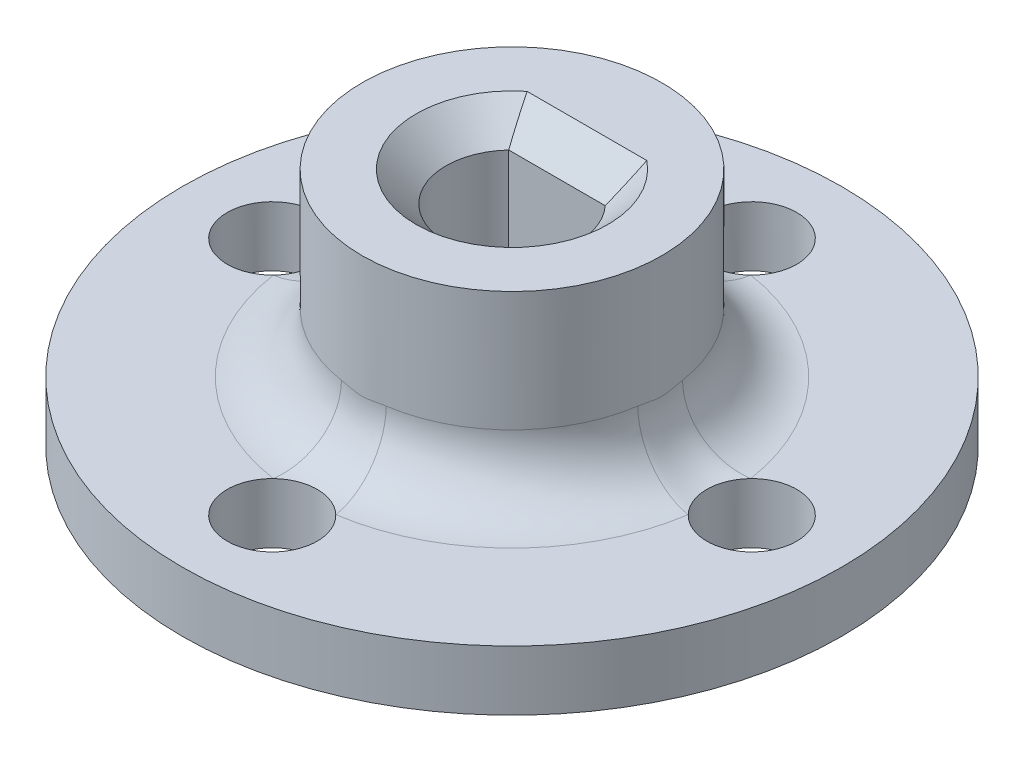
ISO-10303-21;
HEADER;
FILE_DESCRIPTION(('STEP AP214'),'2;1');
FILE_NAME('part.step','',(''),(''),'','','');
FILE_SCHEMA(('AUTOMOTIVE_DESIGN { 1 0 10303 214 1 1 1 1 }'));
ENDSEC;
DATA;
#1=APPLICATION_CONTEXT('core data for automotive mechanical design processes');
#2=APPLICATION_PROTOCOL_DEFINITION('international standard','automotive_design',2000,#1);
#3=PRODUCT_CONTEXT('',#1,'mechanical');
#4=PRODUCT('Part','Part','',(#3));
#5=PRODUCT_RELATED_PRODUCT_CATEGORY('part','',(#4));
#6=PRODUCT_DEFINITION_FORMATION('','',#4);
#7=PRODUCT_DEFINITION_CONTEXT('part definition',#1,'design');
#8=PRODUCT_DEFINITION('design','',#6,#7);
#9=PRODUCT_DEFINITION_SHAPE('','',#8);
#10=(LENGTH_UNIT() NAMED_UNIT(*) SI_UNIT(.MILLI.,.METRE.));
#11=(NAMED_UNIT(*) PLANE_ANGLE_UNIT() SI_UNIT($,.RADIAN.));
#12=(NAMED_UNIT(*) SI_UNIT($,.STERADIAN.) SOLID_ANGLE_UNIT());
#13=UNCERTAINTY_MEASURE_WITH_UNIT(LENGTH_MEASURE(1.E-05),#10,'distance_accuracy_value','');
#14=(GEOMETRIC_REPRESENTATION_CONTEXT(3) GLOBAL_UNCERTAINTY_ASSIGNED_CONTEXT((#13)) GLOBAL_UNIT_ASSIGNED_CONTEXT((#10,
#11,#12)) REPRESENTATION_CONTEXT('',''));
#15=CARTESIAN_POINT('',(0.,0.,0.));
#16=DIRECTION('',(0.,0.,1.));
#17=DIRECTION('',(1.,0.,0.));
#18=AXIS2_PLACEMENT_3D('',#15,#16,#17);
#19=CARTESIAN_POINT('',(0.,2.,0.));
#20=DIRECTION('',(0.,1.,0.));
#21=DIRECTION('',(0.,0.,1.));
#22=AXIS2_PLACEMENT_3D('',#19,#20,#21);
#23=PLANE('',#22);
#24=CARTESIAN_POINT('',(0.,2.,0.));
#25=DIRECTION('',(0.,1.,0.));
#26=DIRECTION('',(0.,0.,1.));
#27=AXIS2_PLACEMENT_3D('',#24,#25,#26);
#28=CIRCLE('',#27,11.);
#29=CARTESIAN_POINT('',(0.,2.,11.));
#30=VERTEX_POINT('',#29);
#31=EDGE_CURVE('E213',#30,#30,#28,.T.);
#32=ORIENTED_EDGE('',*,*,#31,.T.);
#33=EDGE_LOOP('',(#32));
#34=FACE_BOUND('',#33,.T.);
#35=CARTESIAN_POINT('',(0.,2.,8.));
#36=DIRECTION('',(0.,1.,0.));
#37=DIRECTION('',(0.,0.,1.));
#38=AXIS2_PLACEMENT_3D('',#35,#36,#37);
#39=CIRCLE('',#38,1.5);
#40=CARTESIAN_POINT('',(-1.04290291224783,2.,6.921875));
#41=VERTEX_POINT('',#40);
#42=CARTESIAN_POINT('',(1.04290291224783,2.,6.921875));
#43=VERTEX_POINT('',#42);
#44=EDGE_CURVE('E182',#41,#43,#39,.T.);
#45=ORIENTED_EDGE('',*,*,#44,.F.);
#46=CARTESIAN_POINT('',(0.,2.,0.));
#47=DIRECTION('',(0.,1.,0.));
#48=DIRECTION('',(0.,0.,1.));
#49=AXIS2_PLACEMENT_3D('',#46,#47,#48);
#50=CIRCLE('',#49,7.);
#51=CARTESIAN_POINT('',(-6.921875,2.,1.04290291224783));
#52=VERTEX_POINT('',#51);
#53=EDGE_CURVE('E11',#41,#52,#50,.F.);
#54=ORIENTED_EDGE('',*,*,#53,.T.);
#55=CARTESIAN_POINT('',(-8.,2.,0.));
#56=DIRECTION('',(0.,1.,0.));
#57=DIRECTION('',(0.,0.,1.));
#58=AXIS2_PLACEMENT_3D('',#55,#56,#57);
#59=CIRCLE('',#58,1.5);
#60=CARTESIAN_POINT('',(-6.921875,2.,-1.04290291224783));
#61=VERTEX_POINT('',#60);
#62=EDGE_CURVE('E200',#61,#52,#59,.T.);
#63=ORIENTED_EDGE('',*,*,#62,.F.);
#64=CARTESIAN_POINT('',(0.,2.,0.));
#65=DIRECTION('',(0.,1.,0.));
#66=DIRECTION('',(0.,0.,1.));
#67=AXIS2_PLACEMENT_3D('',#64,#65,#66);
#68=CIRCLE('',#67,7.);
#69=CARTESIAN_POINT('',(-1.04290291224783,2.,-6.921875));
#70=VERTEX_POINT('',#69);
#71=EDGE_CURVE('E63',#61,#70,#68,.F.);
#72=ORIENTED_EDGE('',*,*,#71,.T.);
#73=CARTESIAN_POINT('',(0.,2.,-8.));
#74=DIRECTION('',(0.,1.,0.));
#75=DIRECTION('',(0.,0.,1.));
#76=AXIS2_PLACEMENT_3D('',#73,#74,#75);
#77=CIRCLE('',#76,1.5);
#78=CARTESIAN_POINT('',(1.04290291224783,2.,-6.921875));
#79=VERTEX_POINT('',#78);
#80=EDGE_CURVE('E204',#79,#70,#77,.T.);
#81=ORIENTED_EDGE('',*,*,#80,.F.);
#82=CARTESIAN_POINT('',(0.,2.,0.));
#83=DIRECTION('',(0.,1.,0.));
#84=DIRECTION('',(0.,0.,1.));
#85=AXIS2_PLACEMENT_3D('',#82,#83,#84);
#86=CIRCLE('',#85,7.);
#87=CARTESIAN_POINT('',(6.921875,2.,-1.04290291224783));
#88=VERTEX_POINT('',#87);
#89=EDGE_CURVE('E462',#79,#88,#86,.F.);
#90=ORIENTED_EDGE('',*,*,#89,.T.);
#91=CARTESIAN_POINT('',(8.,2.,0.));
#92=DIRECTION('',(0.,1.,0.));
#93=DIRECTION('',(0.,0.,1.));
#94=AXIS2_PLACEMENT_3D('',#91,#92,#93);
#95=CIRCLE('',#94,1.5);
#96=CARTESIAN_POINT('',(6.921875,2.,1.04290291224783));
#97=VERTEX_POINT('',#96);
#98=EDGE_CURVE('E191',#97,#88,#95,.T.);
#99=ORIENTED_EDGE('',*,*,#98,.F.);
#100=CARTESIAN_POINT('',(0.,2.,0.));
#101=DIRECTION('',(0.,1.,0.));
#102=DIRECTION('',(0.,0.,1.));
#103=AXIS2_PLACEMENT_3D('',#100,#101,#102);
#104=CIRCLE('',#103,7.);
#105=EDGE_CURVE('E79',#97,#43,#104,.F.);
#106=ORIENTED_EDGE('',*,*,#105,.T.);
#107=EDGE_LOOP('',(#45,#54,#63,#72,#81,#90,#99,#106));
#108=FACE_BOUND('',#107,.T.);
#109=ADVANCED_FACE('F49',(#34,#108),#23,.T.);
#110=CARTESIAN_POINT('',(0.,0.,0.));
#111=DIRECTION('',(0.,1.,0.));
#112=DIRECTION('',(0.,0.,1.));
#113=AXIS2_PLACEMENT_3D('',#110,#111,#112);
#114=PLANE('',#113);
#115=DIRECTION('',(-1.,0.,0.));
#116=VECTOR('',#115,1.);
#117=CARTESIAN_POINT('',(-1.60934769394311,0.,-1.5));
#118=LINE('',#117,#116);
#119=CARTESIAN_POINT('',(1.60934769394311,0.,-1.5));
#120=VERTEX_POINT('',#119);
#121=CARTESIAN_POINT('',(-1.60934769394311,0.,-1.5));
#122=VERTEX_POINT('',#121);
#123=EDGE_CURVE('E154',#120,#122,#118,.T.);
#124=ORIENTED_EDGE('',*,*,#123,.T.);
#125=CARTESIAN_POINT('',(0.,0.,0.));
#126=DIRECTION('',(0.,1.,0.));
#127=DIRECTION('',(0.,0.,1.));
#128=AXIS2_PLACEMENT_3D('',#125,#126,#127);
#129=CIRCLE('',#128,2.2);
#130=EDGE_CURVE('E145',#122,#120,#129,.T.);
#131=ORIENTED_EDGE('',*,*,#130,.T.);
#132=EDGE_LOOP('',(#124,#131));
#133=FACE_BOUND('',#132,.T.);
#134=CARTESIAN_POINT('',(0.,0.,0.));
#135=DIRECTION('',(0.,1.,0.));
#136=DIRECTION('',(0.,0.,1.));
#137=AXIS2_PLACEMENT_3D('',#134,#135,#136);
#138=CIRCLE('',#137,11.);
#139=CARTESIAN_POINT('',(0.,0.,11.));
#140=VERTEX_POINT('',#139);
#141=EDGE_CURVE('E208',#140,#140,#138,.T.);
#142=ORIENTED_EDGE('',*,*,#141,.F.);
#143=EDGE_LOOP('',(#142));
#144=FACE_BOUND('',#143,.T.);
#145=CARTESIAN_POINT('',(0.,0.,-8.));
#146=DIRECTION('',(0.,1.,0.));
#147=DIRECTION('',(0.,0.,1.));
#148=AXIS2_PLACEMENT_3D('',#145,#146,#147);
#149=CIRCLE('',#148,1.5);
#150=CARTESIAN_POINT('',(0.,0.,-6.5));
#151=VERTEX_POINT('',#150);
#152=EDGE_CURVE('E199',#151,#151,#149,.T.);
#153=ORIENTED_EDGE('',*,*,#152,.T.);
#154=EDGE_LOOP('',(#153));
#155=FACE_BOUND('',#154,.T.);
#156=CARTESIAN_POINT('',(-8.,0.,0.));
#157=DIRECTION('',(0.,1.,0.));
#158=DIRECTION('',(0.,0.,1.));
#159=AXIS2_PLACEMENT_3D('',#156,#157,#158);
#160=CIRCLE('',#159,1.5);
#161=CARTESIAN_POINT('',(-8.,0.,1.5));
#162=VERTEX_POINT('',#161);
#163=EDGE_CURVE('E190',#162,#162,#160,.T.);
#164=ORIENTED_EDGE('',*,*,#163,.T.);
#165=EDGE_LOOP('',(#164));
#166=FACE_BOUND('',#165,.T.);
#167=CARTESIAN_POINT('',(8.,0.,0.));
#168=DIRECTION('',(0.,1.,0.));
#169=DIRECTION('',(0.,0.,1.));
#170=AXIS2_PLACEMENT_3D('',#167,#168,#169);
#171=CIRCLE('',#170,1.5);
#172=CARTESIAN_POINT('',(8.,0.,1.5));
#173=VERTEX_POINT('',#172);
#174=EDGE_CURVE('E181',#173,#173,#171,.T.);
#175=ORIENTED_EDGE('',*,*,#174,.T.);
#176=EDGE_LOOP('',(#175));
#177=FACE_BOUND('',#176,.T.);
#178=CARTESIAN_POINT('',(0.,0.,8.));
#179=DIRECTION('',(0.,1.,0.));
#180=DIRECTION('',(0.,0.,1.));
#181=AXIS2_PLACEMENT_3D('',#178,#179,#180);
#182=CIRCLE('',#181,1.5);
#183=CARTESIAN_POINT('',(0.,0.,9.5));
#184=VERTEX_POINT('',#183);
#185=EDGE_CURVE('E176',#184,#184,#182,.T.);
#186=ORIENTED_EDGE('',*,*,#185,.T.);
#187=EDGE_LOOP('',(#186));
#188=FACE_BOUND('',#187,.T.);
#189=ADVANCED_FACE('F161',(#133,#144,#155,#166,#177,#188),#114,.F.);
#190=CARTESIAN_POINT('',(0.,2.,0.));
#191=DIRECTION('',(0.,-1.,0.));
#192=DIRECTION('',(0.,0.,-1.));
#193=AXIS2_PLACEMENT_3D('',#190,#191,#192);
#194=CYLINDRICAL_SURFACE('',#193,11.);
#195=ORIENTED_EDGE('',*,*,#31,.F.);
#196=EDGE_LOOP('',(#195));
#197=FACE_BOUND('',#196,.T.);
#198=ORIENTED_EDGE('',*,*,#141,.T.);
#199=EDGE_LOOP('',(#198));
#200=FACE_BOUND('',#199,.T.);
#201=ADVANCED_FACE('F369',(#197,#200),#194,.T.);
#202=CARTESIAN_POINT('',(0.,2.,-8.));
#203=DIRECTION('',(0.,-1.,0.));
#204=DIRECTION('',(0.,0.,-1.));
#205=AXIS2_PLACEMENT_3D('',#202,#203,#204);
#206=CYLINDRICAL_SURFACE('',#205,1.5);
#207=ORIENTED_EDGE('',*,*,#80,.T.);
#208=EDGE_CURVE('E209',#70,#79,#77,.T.);
#209=ORIENTED_EDGE('',*,*,#208,.T.);
#210=EDGE_LOOP('',(#207,#209));
#211=FACE_BOUND('',#210,.T.);
#212=ORIENTED_EDGE('',*,*,#152,.F.);
#213=EDGE_LOOP('',(#212));
#214=FACE_BOUND('',#213,.T.);
#215=ADVANCED_FACE('F317',(#211,#214),#206,.F.);
#216=CARTESIAN_POINT('',(-8.,2.,0.));
#217=DIRECTION('',(0.,-1.,0.));
#218=DIRECTION('',(0.,0.,-1.));
#219=AXIS2_PLACEMENT_3D('',#216,#217,#218);
#220=CYLINDRICAL_SURFACE('',#219,1.5);
#221=EDGE_CURVE('E195',#52,#61,#59,.T.);
#222=ORIENTED_EDGE('',*,*,#221,.T.);
#223=ORIENTED_EDGE('',*,*,#62,.T.);
#224=EDGE_LOOP('',(#222,#223));
#225=FACE_BOUND('',#224,.T.);
#226=ORIENTED_EDGE('',*,*,#163,.F.);
#227=EDGE_LOOP('',(#226));
#228=FACE_BOUND('',#227,.T.);
#229=ADVANCED_FACE('F360',(#225,#228),#220,.F.);
#230=CARTESIAN_POINT('',(8.,2.,0.));
#231=DIRECTION('',(0.,-1.,0.));
#232=DIRECTION('',(0.,0.,-1.));
#233=AXIS2_PLACEMENT_3D('',#230,#231,#232);
#234=CYLINDRICAL_SURFACE('',#233,1.5);
#235=EDGE_CURVE('E186',#88,#97,#95,.T.);
#236=ORIENTED_EDGE('',*,*,#235,.T.);
#237=ORIENTED_EDGE('',*,*,#98,.T.);
#238=EDGE_LOOP('',(#236,#237));
#239=FACE_BOUND('',#238,.T.);
#240=ORIENTED_EDGE('',*,*,#174,.F.);
#241=EDGE_LOOP('',(#240));
#242=FACE_BOUND('',#241,.T.);
#243=ADVANCED_FACE('F356',(#239,#242),#234,.F.);
#244=CARTESIAN_POINT('',(0.,2.,8.));
#245=DIRECTION('',(0.,-1.,0.));
#246=DIRECTION('',(0.,0.,-1.));
#247=AXIS2_PLACEMENT_3D('',#244,#245,#246);
#248=CYLINDRICAL_SURFACE('',#247,1.5);
#249=EDGE_CURVE('E177',#43,#41,#39,.T.);
#250=ORIENTED_EDGE('',*,*,#249,.T.);
#251=ORIENTED_EDGE('',*,*,#44,.T.);
#252=EDGE_LOOP('',(#250,#251));
#253=FACE_BOUND('',#252,.T.);
#254=ORIENTED_EDGE('',*,*,#185,.F.);
#255=EDGE_LOOP('',(#254));
#256=FACE_BOUND('',#255,.T.);
#257=ADVANCED_FACE('F359',(#253,#256),#248,.F.);
#258=CARTESIAN_POINT('',(0.,8.,0.));
#259=DIRECTION('',(0.,-1.,0.));
#260=DIRECTION('',(0.,0.,-1.));
#261=AXIS2_PLACEMENT_3D('',#258,#259,#260);
#262=CYLINDRICAL_SURFACE('',#261,5.);
#263=CARTESIAN_POINT('',(0.,4.,0.));
#264=DIRECTION('',(0.,1.,0.));
#265=DIRECTION('',(0.,0.,1.));
#266=AXIS2_PLACEMENT_3D('',#263,#264,#265);
#267=CIRCLE('',#266,5.);
#268=CARTESIAN_POINT('',(-4.94419642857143,4.,0.744930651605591));
#269=VERTEX_POINT('',#268);
#270=CARTESIAN_POINT('',(-0.74493065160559,4.,4.94419642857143));
#271=VERTEX_POINT('',#270);
#272=EDGE_CURVE('E232',#269,#271,#267,.T.);
#273=ORIENTED_EDGE('',*,*,#272,.T.);
#274=CARTESIAN_POINT('',(-1.15151087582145,3.93580249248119,4.86559582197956));
#275=CARTESIAN_POINT('',(-0.652325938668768,1.78846493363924,4.98373487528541));
#276=CARTESIAN_POINT('',(-1.20747950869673,2.,7.11005998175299));
#277=CARTESIAN_POINT('',(-1.12835303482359,3.94376261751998,4.8710767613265));
#278=CARTESIAN_POINT('',(-0.663297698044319,1.79567215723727,4.97863037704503));
#279=CARTESIAN_POINT('',(-1.20167253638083,2.,7.10218566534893));
#280=CARTESIAN_POINT('',(-1.10502984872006,3.95092884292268,4.87642152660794));
#281=CARTESIAN_POINT('',(-0.673787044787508,1.80388967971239,4.97397828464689));
#282=CARTESIAN_POINT('',(-1.19540203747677,2.,7.09383275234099));
#283=CARTESIAN_POINT('',(-1.05811006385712,3.96372071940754,4.88681695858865));
#284=CARTESIAN_POINT('',(-0.693254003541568,1.82229448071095,4.9656527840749));
#285=CARTESIAN_POINT('',(-1.18173729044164,2.,7.07608292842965));
#286=CARTESIAN_POINT('',(-1.0345135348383,3.96934675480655,4.8918676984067));
#287=CARTESIAN_POINT('',(-0.70223063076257,1.83246450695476,4.96197820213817));
#288=CARTESIAN_POINT('',(-1.17434332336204,2.,7.06668627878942));
#289=CARTESIAN_POINT('',(-0.96373589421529,3.98391793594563,4.90647729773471));
#290=CARTESIAN_POINT('',(-0.72597876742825,1.86558202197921,4.95256314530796));
#291=CARTESIAN_POINT('',(-1.1502968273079,2.,7.03694294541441));
#292=CARTESIAN_POINT('',(-0.916219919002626,3.99067320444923,4.91557582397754));
#293=CARTESIAN_POINT('',(-0.737897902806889,1.89130331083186,4.94828633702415));
#294=CARTESIAN_POINT('',(-1.13169889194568,2.,7.0149280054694));
#295=CARTESIAN_POINT('',(-0.844766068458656,3.99687231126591,4.92817946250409));
#296=CARTESIAN_POINT('',(-0.746828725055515,1.9344511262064,4.94483466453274));
#297=CARTESIAN_POINT('',(-1.09836172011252,2.,6.97830309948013));
#298=CARTESIAN_POINT('',(-0.820988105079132,3.99828460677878,4.93219638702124));
#299=CARTESIAN_POINT('',(-0.748333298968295,1.9494359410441,4.9441732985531));
#300=CARTESIAN_POINT('',(-1.08638560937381,2.,6.96553702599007));
#301=CARTESIAN_POINT('',(-0.773354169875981,3.999933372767,4.93988914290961));
#302=CARTESIAN_POINT('',(-0.747944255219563,1.98056350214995,4.94375154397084));
#303=CARTESIAN_POINT('',(-1.06026690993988,2.,6.93878099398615));
#304=CARTESIAN_POINT('',(-0.749498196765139,4.00016982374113,4.94356496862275));
#305=CARTESIAN_POINT('',(-0.746076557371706,1.9966852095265,4.94398448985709));
#306=CARTESIAN_POINT('',(-1.04612428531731,2.,6.92479101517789));
#307=CARTESIAN_POINT('',(-0.701687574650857,3.99959641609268,4.95057773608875));
#308=CARTESIAN_POINT('',(-0.738516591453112,2.02977119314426,4.94525762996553));
#309=CARTESIAN_POINT('',(-1.01524972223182,2.,6.895590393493));
#310=CARTESIAN_POINT('',(-0.677732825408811,3.99878410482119,4.95391386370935));
#311=CARTESIAN_POINT('',(-0.732849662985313,2.04671917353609,4.9462925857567));
#312=CARTESIAN_POINT('',(-0.998511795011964,2.,6.88037696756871));
#313=CARTESIAN_POINT('',(-0.629802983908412,3.99626736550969,4.9602351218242));
#314=CARTESIAN_POINT('',(-0.717323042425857,2.08100293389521,4.94904149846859));
#315=CARTESIAN_POINT('',(-0.962026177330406,2.,6.84887627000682));
#316=CARTESIAN_POINT('',(-0.605827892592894,3.99456297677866,4.9632202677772));
#317=CARTESIAN_POINT('',(-0.707505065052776,2.09832510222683,4.95074863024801));
#318=CARTESIAN_POINT('',(-0.942278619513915,2.,6.83258904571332));
#319=CARTESIAN_POINT('',(-0.549959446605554,3.98976537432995,4.96976614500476));
#320=CARTESIAN_POINT('',(-0.679457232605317,2.13853311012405,4.95532826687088));
#321=CARTESIAN_POINT('',(-0.892200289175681,2.,6.79364380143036));
#322=CARTESIAN_POINT('',(-0.518062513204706,3.98639950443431,4.97319199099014));
#323=CARTESIAN_POINT('',(-0.659559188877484,2.16143789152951,4.95839713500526));
#324=CARTESIAN_POINT('',(-0.860527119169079,2.,6.77065630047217));
#325=CARTESIAN_POINT('',(-0.45425128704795,3.97891972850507,4.97942605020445));
#326=CARTESIAN_POINT('',(-0.611447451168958,2.20589354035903,4.96502821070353));
#327=CARTESIAN_POINT('',(-0.789852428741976,2.,6.72409972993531));
#328=CARTESIAN_POINT('',(-0.422336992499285,3.97480571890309,4.98223417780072));
#329=CARTESIAN_POINT('',(-0.583339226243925,2.22745773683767,4.96858388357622));
#330=CARTESIAN_POINT('',(-0.750849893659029,2.,6.70053058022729));
#331=CARTESIAN_POINT('',(-0.358468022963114,3.96642299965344,4.98723639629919));
#332=CARTESIAN_POINT('',(-0.51892612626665,2.26789885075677,4.97569758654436));
#333=CARTESIAN_POINT('',(-0.664608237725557,2.,6.65438373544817));
#334=CARTESIAN_POINT('',(-0.326513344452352,3.96215427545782,4.98943042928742));
#335=CARTESIAN_POINT('',(-0.48269555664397,2.28682162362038,4.97925807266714));
#336=CARTESIAN_POINT('',(-0.617368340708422,2.,6.63180613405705));
#337=CARTESIAN_POINT('',(-0.262535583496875,3.95411277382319,4.99320556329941));
#338=CARTESIAN_POINT('',(-0.402839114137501,2.32062262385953,4.98587300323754));
#339=CARTESIAN_POINT('',(-0.514463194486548,2.,6.5898926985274));
#340=CARTESIAN_POINT('',(-0.230512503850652,3.95033997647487,4.9947866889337));
#341=CARTESIAN_POINT('',(-0.359219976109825,2.33557351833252,4.98893866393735));
#342=CARTESIAN_POINT('',(-0.458798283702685,2.,6.57055673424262));
#343=CARTESIAN_POINT('',(-0.1663256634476,3.94392000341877,4.99733618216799));
#344=CARTESIAN_POINT('',(-0.266175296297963,2.36021575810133,4.99410112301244));
#345=CARTESIAN_POINT('',(-0.340067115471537,2.,6.53776312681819));
#346=CARTESIAN_POINT('',(-0.134161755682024,3.94127476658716,4.99830349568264));
#347=CARTESIAN_POINT('',(-0.216646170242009,2.36997746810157,4.99621182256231));
#348=CARTESIAN_POINT('',(-0.276988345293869,2.,6.52431560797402));
#349=CARTESIAN_POINT('',(-0.0697745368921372,3.9376143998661,4.99961678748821));
#350=CARTESIAN_POINT('',(-0.114442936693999,2.38329932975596,4.99911298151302));
#351=CARTESIAN_POINT('',(-0.146375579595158,2.,6.50570745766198));
#352=CARTESIAN_POINT('',(-0.037551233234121,3.93659907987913,4.9999628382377));
#353=CARTESIAN_POINT('',(-0.0615784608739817,2.38691463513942,4.9999153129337));
#354=CARTESIAN_POINT('',(-0.0788421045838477,2.,6.50054585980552));
#355=CARTESIAN_POINT('',(0.0269049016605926,3.93640065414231,5.00003149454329));
#356=CARTESIAN_POINT('',(0.044106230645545,2.38762341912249,5.0000717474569));
#357=CARTESIAN_POINT('',(0.0564855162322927,2.,6.49953744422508));
#358=CARTESIAN_POINT('',(0.0591377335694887,3.9372178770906,4.99975398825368));
#359=CARTESIAN_POINT('',(0.0971620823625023,2.3847188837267,4.99942628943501));
#360=CARTESIAN_POINT('',(0.124279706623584,2.,6.50369229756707));
#361=CARTESIAN_POINT('',(0.123549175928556,3.94052158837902,4.99857714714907));
#362=CARTESIAN_POINT('',(0.200062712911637,2.37273968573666,4.99681055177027));
#363=CARTESIAN_POINT('',(0.255826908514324,2.,6.52048530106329));
#364=CARTESIAN_POINT('',(0.155727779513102,3.94300827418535,4.99767773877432));
#365=CARTESIAN_POINT('',(0.250106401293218,2.36361447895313,4.99482932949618));
#366=CARTESIAN_POINT('',(0.319579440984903,2.,6.53312445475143));
#367=CARTESIAN_POINT('',(0.220129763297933,3.9491937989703,4.99525632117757));
#368=CARTESIAN_POINT('',(0.344669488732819,2.34005133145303,4.98986525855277));
#369=CARTESIAN_POINT('',(0.440228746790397,2.,6.56468814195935));
#370=CARTESIAN_POINT('',(0.252352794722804,3.95289751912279,4.99373179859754));
#371=CARTESIAN_POINT('',(0.389270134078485,2.3255132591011,4.98686271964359));
#372=CARTESIAN_POINT('',(0.497096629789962,2.,6.58363799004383));
#373=CARTESIAN_POINT('',(0.316725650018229,3.96087611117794,4.99006255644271));
#374=CARTESIAN_POINT('',(0.471111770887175,2.29235686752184,4.98031745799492));
#375=CARTESIAN_POINT('',(0.602349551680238,2.,6.62508665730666));
#376=CARTESIAN_POINT('',(0.34887547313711,3.96515098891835,4.98791783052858));
#377=CARTESIAN_POINT('',(0.508355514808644,2.27366280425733,4.97676258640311));
#378=CARTESIAN_POINT('',(0.650734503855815,2.,6.64758551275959));
#379=CARTESIAN_POINT('',(0.413112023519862,3.97360423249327,4.98300865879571));
#380=CARTESIAN_POINT('',(0.57471369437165,2.23353219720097,4.9696140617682));
#381=CARTESIAN_POINT('',(0.739080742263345,2.,6.69376566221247));
#382=CARTESIAN_POINT('',(0.445198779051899,3.9777826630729,4.98024464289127));
#383=CARTESIAN_POINT('',(0.603762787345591,2.21204746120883,4.96601697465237));
#384=CARTESIAN_POINT('',(0.77904783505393,2.,6.71744612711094));
#385=CARTESIAN_POINT('',(0.50935793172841,3.98543641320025,4.97409217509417));
#386=CARTESIAN_POINT('',(0.653658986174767,2.16761692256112,4.95926463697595));
#387=CARTESIAN_POINT('',(0.85147674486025,2.,6.76434228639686));
#388=CARTESIAN_POINT('',(0.541430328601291,3.98891171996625,4.97070371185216));
#389=CARTESIAN_POINT('',(0.674399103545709,2.14465434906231,4.95611532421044));
#390=CARTESIAN_POINT('',(0.883938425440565,2.,6.78755797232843));
#391=CARTESIAN_POINT('',(0.605796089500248,3.99465426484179,4.96327190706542));
#392=CARTESIAN_POINT('',(0.708142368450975,2.09830082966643,4.95067527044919));
#393=CARTESIAN_POINT('',(0.942729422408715,2.,6.83267635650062));
#394=CARTESIAN_POINT('',(0.638089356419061,3.99691249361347,4.95922396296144));
#395=CARTESIAN_POINT('',(0.72097304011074,2.07492393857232,4.94840449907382));
#396=CARTESIAN_POINT('',(0.969012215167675,2.,6.8545682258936));
#397=CARTESIAN_POINT('',(0.702623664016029,3.99973701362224,4.95049291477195));
#398=CARTESIAN_POINT('',(0.739328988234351,2.0290097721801,4.94512816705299));
#399=CARTESIAN_POINT('',(1.01630828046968,2.,6.8963202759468));
#400=CARTESIAN_POINT('',(0.734864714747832,4.00030368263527,4.94580995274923));
#401=CARTESIAN_POINT('',(0.74475797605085,2.00650896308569,4.94413933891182));
#402=CARTESIAN_POINT('',(1.03732272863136,2.,6.91618090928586));
#403=CARTESIAN_POINT('',(0.799433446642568,3.99937964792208,4.93578552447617));
#404=CARTESIAN_POINT('',(0.749236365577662,1.96316066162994,4.94371550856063));
#405=CARTESIAN_POINT('',(1.07525166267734,2.,6.95378868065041));
#406=CARTESIAN_POINT('',(0.831760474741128,3.9978764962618,4.93044025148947));
#407=CARTESIAN_POINT('',(0.748173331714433,1.94237619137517,4.94430735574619));
#408=CARTESIAN_POINT('',(1.09214061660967,2.,6.97152232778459));
#409=CARTESIAN_POINT('',(0.896236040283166,3.99251516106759,4.9191296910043));
#410=CARTESIAN_POINT('',(0.740643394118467,1.90331201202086,4.94723158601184));
#411=CARTESIAN_POINT('',(1.12250805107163,2.,7.0047852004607));
#412=CARTESIAN_POINT('',(0.928384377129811,3.98865472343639,4.91316381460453));
#413=CARTESIAN_POINT('',(0.734125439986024,1.88508926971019,4.94958002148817));
#414=CARTESIAN_POINT('',(1.1359832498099,2.,7.02031229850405));
#415=CARTESIAN_POINT('',(0.96037756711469,3.98347891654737,4.90690074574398));
#416=CARTESIAN_POINT('',(0.725545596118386,1.86856650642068,4.95286200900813));
#417=CARTESIAN_POINT('',(1.14816398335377,2.,7.03474383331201));
#418=(BOUNDED_SURFACE() B_SPLINE_SURFACE(3,2,((#274,#275,#276),(#277,#278,#279),(#280,#281,
#282),(#283,#284,#285),(#286,#287,#288),(#289,#290,#291),(#292,#293,#294),(#295,#296,#297),
(#298,#299,#300),(#301,#302,#303),(#304,#305,#306),(#307,#308,#309),(#310,#311,#312),(#313,#314,
#315),(#316,#317,#318),(#319,#320,#321),(#322,#323,#324),(#325,#326,#327),(#328,#329,#330),
(#331,#332,#333),(#334,#335,#336),(#337,#338,#339),(#340,#341,#342),(#343,#344,#345),(#346,#347,
#348),(#349,#350,#351),(#352,#353,#354),(#355,#356,#357),(#358,#359,#360),(#361,#362,#363),
(#364,#365,#366),(#367,#368,#369),(#370,#371,#372),(#373,#374,#375),(#376,#377,#378),(#379,#380,
#381),(#382,#383,#384),(#385,#386,#387),(#388,#389,#390),(#391,#392,#393),(#394,#395,#396),
(#397,#398,#399),(#400,#401,#402),(#403,#404,#405),(#406,#407,#408),(#409,#410,#411),(#412,#413,
#414),(#415,#416,#417)),.UNSPECIFIED.,.F.,.F.,.F.) B_SPLINE_SURFACE_WITH_KNOTS((4,2,2,2,2,2,2,2,
2,2,2,2,2,2,2,2,2,2,2,2,2,2,2,4),(3,3),(0.,0.10273807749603,0.205450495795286,0.409343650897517,
0.510697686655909,0.612053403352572,0.713646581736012,0.815235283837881,0.950329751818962,
1.08544293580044,1.22056885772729,1.35568935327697,1.49104126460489,1.62637738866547,
1.76173778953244,1.89711420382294,2.03304033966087,2.16896786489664,2.30480131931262,
2.44063724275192,2.57746533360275,2.71426286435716,2.85188670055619,2.98964234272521),(0.,1.),
.UNSPECIFIED.) GEOMETRIC_REPRESENTATION_ITEM() RATIONAL_B_SPLINE_SURFACE(((1.,0.671375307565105,
1.),(1.,0.67264068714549,1.),(1.,0.674043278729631,1.),(1.,0.677134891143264,1.),(1.,
0.678823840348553,1.),(1.,0.68431185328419,1.),(1.,0.688550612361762,1.),(1.,0.69577770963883,
1.),(1.,0.698322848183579,1.),(1.,0.703691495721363,1.),(1.,0.706515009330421,1.),(1.,
0.712423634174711,1.),(1.,0.715509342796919,1.),(1.,0.72189568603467,1.),(1.,0.725196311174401,
1.),(1.,0.733066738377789,1.),(1.,0.737696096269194,1.),(1.,0.747011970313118,1.),(1.,
0.751698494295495,1.),(1.,0.760805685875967,1.),(1.,0.765226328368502,1.),(1.,0.773375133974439,
1.),(1.,0.77710332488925,1.),(1.,0.783393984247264,1.),(1.,0.785954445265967,1.),(1.,
0.789490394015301,1.),(1.,0.790466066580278,1.),(1.,0.790656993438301,1.),(1.,0.789871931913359,
1.),(1.,0.786683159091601,1.),(1.,0.78427925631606,1.),(1.,0.77823222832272,1.),(1.,
0.774584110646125,1.),(1.,0.766537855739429,1.),(1.,0.762139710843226,1.),(1.,0.753039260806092,
1.),(1.,0.748337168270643,1.),(1.,0.738964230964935,1.),(1.,0.734293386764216,1.),(1.,
0.725181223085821,1.),(1.,0.720741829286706,1.),(1.,0.712276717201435,1.),(1.,0.70825090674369,
1.),(1.,0.700671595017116,1.),(1.,0.697121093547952,1.),(1.,0.690547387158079,1.),(1.,
0.687524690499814,1.),(1.,0.684782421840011,1.))) REPRESENTATION_ITEM('') SURFACE());
#419=CARTESIAN_POINT('',(-1.15151087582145,3.93580249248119,4.86559582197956));
#420=CARTESIAN_POINT('',(-1.12835303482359,3.94376261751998,4.8710767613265));
#421=CARTESIAN_POINT('',(-1.10502984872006,3.95092884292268,4.87642152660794));
#422=CARTESIAN_POINT('',(-1.05811006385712,3.96372071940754,4.88681695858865));
#423=CARTESIAN_POINT('',(-1.0345135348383,3.96934675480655,4.8918676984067));
#424=CARTESIAN_POINT('',(-0.96373589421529,3.98391793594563,4.90647729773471));
#425=CARTESIAN_POINT('',(-0.916219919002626,3.99067320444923,4.91557582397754));
#426=CARTESIAN_POINT('',(-0.844766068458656,3.99687231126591,4.92817946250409));
#427=CARTESIAN_POINT('',(-0.820988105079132,3.99828460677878,4.93219638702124));
#428=CARTESIAN_POINT('',(-0.773354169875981,3.999933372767,4.93988914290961));
#429=CARTESIAN_POINT('',(-0.749498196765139,4.00016982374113,4.94356496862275));
#430=CARTESIAN_POINT('',(-0.701687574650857,3.99959641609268,4.95057773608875));
#431=CARTESIAN_POINT('',(-0.677732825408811,3.99878410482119,4.95391386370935));
#432=CARTESIAN_POINT('',(-0.629802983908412,3.99626736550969,4.9602351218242));
#433=CARTESIAN_POINT('',(-0.605827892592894,3.99456297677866,4.9632202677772));
#434=CARTESIAN_POINT('',(-0.549959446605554,3.98976537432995,4.96976614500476));
#435=CARTESIAN_POINT('',(-0.518062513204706,3.98639950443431,4.97319199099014));
#436=CARTESIAN_POINT('',(-0.45425128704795,3.97891972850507,4.97942605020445));
#437=CARTESIAN_POINT('',(-0.422336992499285,3.97480571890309,4.98223417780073));
#438=CARTESIAN_POINT('',(-0.358468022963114,3.96642299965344,4.98723639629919));
#439=CARTESIAN_POINT('',(-0.326513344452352,3.96215427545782,4.98943042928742));
#440=CARTESIAN_POINT('',(-0.262535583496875,3.95411277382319,4.99320556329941));
#441=CARTESIAN_POINT('',(-0.230512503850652,3.95033997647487,4.9947866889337));
#442=CARTESIAN_POINT('',(-0.166325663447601,3.94392000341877,4.99733618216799));
#443=CARTESIAN_POINT('',(-0.134161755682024,3.94127476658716,4.99830349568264));
#444=CARTESIAN_POINT('',(-0.0697745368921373,3.9376143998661,4.99961678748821));
#445=CARTESIAN_POINT('',(-0.037551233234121,3.93659907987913,4.9999628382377));
#446=CARTESIAN_POINT('',(0.0269049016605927,3.93640065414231,5.00003149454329));
#447=CARTESIAN_POINT('',(0.0591377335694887,3.9372178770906,4.99975398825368));
#448=CARTESIAN_POINT('',(0.123549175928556,3.94052158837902,4.99857714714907));
#449=CARTESIAN_POINT('',(0.155727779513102,3.94300827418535,4.99767773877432));
#450=CARTESIAN_POINT('',(0.220129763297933,3.9491937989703,4.99525632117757));
#451=CARTESIAN_POINT('',(0.252352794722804,3.95289751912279,4.99373179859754));
#452=CARTESIAN_POINT('',(0.316725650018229,3.96087611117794,4.99006255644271));
#453=CARTESIAN_POINT('',(0.34887547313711,3.96515098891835,4.98791783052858));
#454=CARTESIAN_POINT('',(0.413112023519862,3.97360423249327,4.98300865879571));
#455=CARTESIAN_POINT('',(0.445198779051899,3.9777826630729,4.98024464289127));
#456=CARTESIAN_POINT('',(0.50935793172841,3.98543641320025,4.97409217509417));
#457=CARTESIAN_POINT('',(0.541430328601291,3.98891171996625,4.97070371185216));
#458=CARTESIAN_POINT('',(0.605796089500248,3.99465426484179,4.96327190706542));
#459=CARTESIAN_POINT('',(0.638089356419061,3.99691249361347,4.95922396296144));
#460=CARTESIAN_POINT('',(0.702623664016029,3.99973701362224,4.95049291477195));
#461=CARTESIAN_POINT('',(0.734864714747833,4.00030368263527,4.94580995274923));
#462=CARTESIAN_POINT('',(0.799433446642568,3.99937964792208,4.93578552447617));
#463=CARTESIAN_POINT('',(0.831760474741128,3.99787649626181,4.93044025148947));
#464=CARTESIAN_POINT('',(0.896236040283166,3.99251516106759,4.9191296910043));
#465=CARTESIAN_POINT('',(0.928384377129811,3.98865472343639,4.91316381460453));
#466=CARTESIAN_POINT('',(0.96037756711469,3.98347891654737,4.90690074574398));
#467=B_SPLINE_CURVE_WITH_KNOTS('',3,(#419,#420,#421,#422,#423,#424,#425,#426,#427,#428,#429,
#430,#431,#432,#433,#434,#435,#436,#437,#438,#439,#440,#441,#442,#443,#444,#445,#446,#447,#448,
#449,#450,#451,#452,#453,#454,#455,#456,#457,#458,#459,#460,#461,#462,#463,#464,#465,#466),
.UNSPECIFIED.,.F.,.F.,(4,2,2,2,2,2,2,2,2,2,2,2,2,2,2,2,2,2,2,2,2,2,2,4),(0.,0.10273807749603,
0.205450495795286,0.409343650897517,0.510697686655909,0.612053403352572,0.713646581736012,
0.815235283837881,0.950329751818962,1.08544293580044,1.22056885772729,1.35568935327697,
1.49104126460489,1.62637738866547,1.76173778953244,1.89711420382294,2.03304033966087,
2.16896786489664,2.30480131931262,2.44063724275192,2.57746533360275,2.71426286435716,
2.85188670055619,2.98964234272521),.UNSPECIFIED.);
#468=CARTESIAN_POINT('',(0.744930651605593,4.,4.94419642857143));
#469=VERTEX_POINT('',#468);
#470=EDGE_CURVE('E442',#271,#469,#467,.T.);
#471=ORIENTED_EDGE('',*,*,#470,.T.);
#472=CARTESIAN_POINT('',(0.,4.,0.));
#473=DIRECTION('',(0.,1.,0.));
#474=DIRECTION('',(0.,0.,1.));
#475=AXIS2_PLACEMENT_3D('',#472,#473,#474);
#476=CIRCLE('',#475,5.);
#477=CARTESIAN_POINT('',(4.94419642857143,4.,0.744930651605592));
#478=VERTEX_POINT('',#477);
#479=EDGE_CURVE('E390',#469,#478,#476,.T.);
#480=ORIENTED_EDGE('',*,*,#479,.T.);
#481=CARTESIAN_POINT('',(4.86559582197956,3.93580249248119,1.15151087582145));
#482=CARTESIAN_POINT('',(4.98373487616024,1.78846495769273,0.652325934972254));
#483=CARTESIAN_POINT('',(7.11005996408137,2.,1.20747949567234));
#484=CARTESIAN_POINT('',(4.87107676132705,3.94376261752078,1.12835303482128));
#485=CARTESIAN_POINT('',(4.97863037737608,1.7956721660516,0.663297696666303));
#486=CARTESIAN_POINT('',(7.10218565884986,2.,1.20167253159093));
#487=CARTESIAN_POINT('',(4.876421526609,3.95092884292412,1.10502984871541));
#488=CARTESIAN_POINT('',(4.97397828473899,1.80388968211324,0.673787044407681));
#489=CARTESIAN_POINT('',(7.0938327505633,2.,1.19540203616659));
#490=CARTESIAN_POINT('',(4.8868169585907,3.96372071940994,1.05811006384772));
#491=CARTESIAN_POINT('',(4.96565278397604,1.82229447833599,0.693254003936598));
#492=CARTESIAN_POINT('',(7.07608293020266,2.,1.18173729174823));
#493=CARTESIAN_POINT('',(4.89186769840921,3.96934675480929,1.03451353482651));
#494=CARTESIAN_POINT('',(4.96197820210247,1.83246450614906,0.702230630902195));
#495=CARTESIAN_POINT('',(7.06668627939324,2.,1.17434332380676));
#496=CARTESIAN_POINT('',(4.90647729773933,3.98391793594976,0.963735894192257));
#497=CARTESIAN_POINT('',(4.95256314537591,1.86558202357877,0.725978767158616));
#498=CARTESIAN_POINT('',(7.03694294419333,2.,1.15029682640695));
#499=CARTESIAN_POINT('',(4.9155758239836,3.99067320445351,0.91621991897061));
#500=CARTESIAN_POINT('',(4.9482863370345,1.89130331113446,0.737897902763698));
#501=CARTESIAN_POINT('',(7.01492800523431,2.,1.13169889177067));
#502=CARTESIAN_POINT('',(4.92817946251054,3.99687231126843,0.844766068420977));
#503=CARTESIAN_POINT('',(4.94483466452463,1.93445112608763,0.746828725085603));
#504=CARTESIAN_POINT('',(6.97830309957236,2.,1.09836172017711));
#505=CARTESIAN_POINT('',(4.93219638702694,3.99828460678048,0.820988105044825));
#506=CARTESIAN_POINT('',(4.94417329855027,1.94943594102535,0.748333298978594));
#507=CARTESIAN_POINT('',(6.96553702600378,2.,1.08638560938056));
#508=CARTESIAN_POINT('',(4.9398891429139,3.99993337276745,0.773354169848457));
#509=CARTESIAN_POINT('',(4.94375154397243,1.98056350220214,0.747944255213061));
#510=CARTESIAN_POINT('',(6.93878099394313,2.,1.06026690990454));
#511=CARTESIAN_POINT('',(4.94356496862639,4.00016982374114,0.749498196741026));
#512=CARTESIAN_POINT('',(4.94398448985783,1.99668520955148,0.746076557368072));
#513=CARTESIAN_POINT('',(6.92479101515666,2.,1.04612428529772));
#514=CARTESIAN_POINT('',(4.95057773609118,3.99959641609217,0.701687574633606));
#515=CARTESIAN_POINT('',(4.94525762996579,2.02977119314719,0.73851659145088));
#516=CARTESIAN_POINT('',(6.89559039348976,2.,1.01524972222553));
#517=CARTESIAN_POINT('',(4.95391386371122,3.99878410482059,0.677732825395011));
#518=CARTESIAN_POINT('',(4.94629258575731,2.04671917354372,0.73284966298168));
#519=CARTESIAN_POINT('',(6.88037696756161,2.,0.998511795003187));
#520=CARTESIAN_POINT('',(4.96023512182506,3.9962673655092,0.629802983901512));
#521=CARTESIAN_POINT('',(4.9490414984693,2.08100293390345,0.717323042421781));
#522=CARTESIAN_POINT('',(6.84887626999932,2.,0.962026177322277));
#523=CARTESIAN_POINT('',(4.96322026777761,3.99456297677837,0.605827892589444));
#524=CARTESIAN_POINT('',(4.95074863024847,2.09832510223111,0.707505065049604));
#525=CARTESIAN_POINT('',(6.83258904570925,2.,0.942278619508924));
#526=CARTESIAN_POINT('',(4.96976614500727,3.98976537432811,0.549959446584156));
#527=CARTESIAN_POINT('',(4.9553282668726,2.13853311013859,0.679457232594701));
#528=CARTESIAN_POINT('',(6.79364380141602,2.,0.89220028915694));
#529=CARTESIAN_POINT('',(4.97319199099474,3.98639950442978,0.518062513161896));
#530=CARTESIAN_POINT('',(4.95839713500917,2.16143789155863,0.659559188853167));
#531=CARTESIAN_POINT('',(6.77065630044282,2.,0.86052711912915));
#532=CARTESIAN_POINT('',(4.9794260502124,3.97891972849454,0.45425128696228));
#533=CARTESIAN_POINT('',(4.96502821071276,2.20589354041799,0.611447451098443));
#534=CARTESIAN_POINT('',(6.72409972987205,2.,0.789852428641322));
#535=CARTESIAN_POINT('',(4.98223417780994,3.97480571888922,0.422336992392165));
#536=CARTESIAN_POINT('',(4.96858388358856,2.22745773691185,0.583339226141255));
#537=CARTESIAN_POINT('',(6.70053058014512,2.,0.750849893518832));
#538=CARTESIAN_POINT('',(4.98723639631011,3.96642299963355,0.358468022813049));
#539=CARTESIAN_POINT('',(4.97569758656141,2.26789885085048,0.518926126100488));
#540=CARTESIAN_POINT('',(6.65438373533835,2.,0.664608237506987));
#541=CARTESIAN_POINT('',(4.98943042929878,3.96215427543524,0.326513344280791));
#542=CARTESIAN_POINT('',(4.97925807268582,2.28682162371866,0.482695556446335));
#543=CARTESIAN_POINT('',(6.63180613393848,2.,0.617368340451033));
#544=CARTESIAN_POINT('',(4.99320556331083,3.95411277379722,0.262535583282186));
#545=CARTESIAN_POINT('',(4.9858730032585,2.32062262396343,0.402839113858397));
#546=CARTESIAN_POINT('',(6.58989269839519,2.,0.514463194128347));
#547=CARTESIAN_POINT('',(4.99478668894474,3.9503399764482,0.230512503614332));
#548=CARTESIAN_POINT('',(4.98893866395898,2.33557351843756,0.35921997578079));
#549=CARTESIAN_POINT('',(6.57055673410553,2.,0.458798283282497));
#550=CARTESIAN_POINT('',(4.99733618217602,3.94392000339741,0.166325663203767));
#551=CARTESIAN_POINT('',(4.99410112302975,2.36021575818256,0.2661752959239));
#552=CARTESIAN_POINT('',(6.5377631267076,2.,0.340067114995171));
#553=CARTESIAN_POINT('',(4.99830349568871,3.94127476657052,0.134161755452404));
#554=CARTESIAN_POINT('',(4.99621182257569,2.3699774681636,0.21664616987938));
#555=CARTESIAN_POINT('',(6.52431560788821,2.,0.2769883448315));
#556=CARTESIAN_POINT('',(4.99961678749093,3.93761439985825,0.0697745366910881));
#557=CARTESIAN_POINT('',(4.99911298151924,2.38329932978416,0.11444293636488));
#558=CARTESIAN_POINT('',(6.50570745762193,2.,0.146375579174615));
#559=CARTESIAN_POINT('',(4.99996283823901,3.93659907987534,0.0375512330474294));
#560=CARTESIAN_POINT('',(4.99991531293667,2.38691463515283,0.0615784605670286));
#561=CARTESIAN_POINT('',(6.50054585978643,2.,0.0788421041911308));
#562=CARTESIAN_POINT('',(5.00003149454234,3.93640065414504,-0.0269049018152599));
#563=CARTESIAN_POINT('',(5.00007174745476,2.38762341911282,-0.0441062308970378));
#564=CARTESIAN_POINT('',(6.49953744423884,2.,-0.056485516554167));
#565=CARTESIAN_POINT('',(4.99975398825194,3.93721787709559,-0.0591377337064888));
#566=CARTESIAN_POINT('',(4.99942628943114,2.38471888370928,-0.0971620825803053));
#567=CARTESIAN_POINT('',(6.50369229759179,2.,-0.124279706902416));
#568=CARTESIAN_POINT('',(4.99857714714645,3.94052158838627,-0.123549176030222));
#569=CARTESIAN_POINT('',(4.99681055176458,2.37273968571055,-0.200062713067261));
#570=CARTESIAN_POINT('',(6.52048530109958,2.,-0.255826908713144));
#571=CARTESIAN_POINT('',(4.99767773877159,3.9430082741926,-0.1557277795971));
#572=CARTESIAN_POINT('',(4.99482932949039,2.3636144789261,-0.250106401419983));
#573=CARTESIAN_POINT('',(6.53312445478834,2.,-0.319579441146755));
#574=CARTESIAN_POINT('',(4.99525632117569,3.94919379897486,-0.220129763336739));
#575=CARTESIAN_POINT('',(4.98986525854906,2.34005133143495,-0.344669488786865));
#576=CARTESIAN_POINT('',(6.56468814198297,2.,-0.440228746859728));
#577=CARTESIAN_POINT('',(4.99373179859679,3.95289751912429,-0.252352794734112));
#578=CARTESIAN_POINT('',(4.98686271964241,2.32551325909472,-0.389270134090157));
#579=CARTESIAN_POINT('',(6.58363799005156,2.,-0.497096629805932));
#580=CARTESIAN_POINT('',(4.99006255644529,3.96087611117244,-0.316725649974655));
#581=CARTESIAN_POINT('',(4.98031745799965,2.29235686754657,-0.47111177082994));
#582=CARTESIAN_POINT('',(6.62508665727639,2.,-0.602349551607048));
#583=CARTESIAN_POINT('',(4.98791783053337,3.96515098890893,-0.348875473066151));
#584=CARTESIAN_POINT('',(4.97676258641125,2.27366280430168,-0.508355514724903));
#585=CARTESIAN_POINT('',(6.6475855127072,2.,-0.650734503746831));
#586=CARTESIAN_POINT('',(4.98300865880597,3.97360423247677,-0.413112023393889));
#587=CARTESIAN_POINT('',(4.96961406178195,2.23353219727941,-0.574713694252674));
#588=CARTESIAN_POINT('',(6.69376566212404,2.,-0.739080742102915));
#589=CARTESIAN_POINT('',(4.98024464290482,3.97778266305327,-0.445198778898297));
#590=CARTESIAN_POINT('',(4.96601697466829,2.21204746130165,-0.603762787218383));
#591=CARTESIAN_POINT('',(6.71744612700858,2.,-0.779047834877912));
#592=CARTESIAN_POINT('',(4.97409217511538,3.98543641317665,-0.509357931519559));
#593=CARTESIAN_POINT('',(4.95926463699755,2.16761692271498,-0.653658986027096));
#594=CARTESIAN_POINT('',(6.76434228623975,2.,-0.85147674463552));
#595=CARTESIAN_POINT('',(4.97070371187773,3.98891171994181,-0.541430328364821));
#596=CARTESIAN_POINT('',(4.95611532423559,2.14465434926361,-0.674399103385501));
#597=CARTESIAN_POINT('',(6.78755797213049,2.,-0.883938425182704));
#598=CARTESIAN_POINT('',(4.96327190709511,3.99465426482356,-0.605796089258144));
#599=CARTESIAN_POINT('',(4.9506752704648,2.09830082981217,-0.70814236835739));
#600=CARTESIAN_POINT('',(6.83267635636,2.,-0.942729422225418));
#601=CARTESIAN_POINT('',(4.95922396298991,3.99691249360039,-0.638089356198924));
#602=CARTESIAN_POINT('',(4.9484044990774,2.07492393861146,-0.720973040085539));
#603=CARTESIAN_POINT('',(6.85456822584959,2.,-0.969012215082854));
#604=CARTESIAN_POINT('',(4.95049291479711,3.99973701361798,-0.702623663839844));
#605=CARTESIAN_POINT('',(4.94512816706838,2.02900977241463,-0.73932898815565));
#606=CARTESIAN_POINT('',(6.89632027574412,2.,-1.01630828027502));
#607=CARTESIAN_POINT('',(4.94580995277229,4.00030368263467,-0.734864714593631));
#608=CARTESIAN_POINT('',(4.94413933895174,2.00650896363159,-0.74475797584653));
#609=CARTESIAN_POINT('',(6.91618090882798,2.,-1.03732272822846));
#610=CARTESIAN_POINT('',(4.93578552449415,3.99937964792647,-0.799433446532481));
#611=CARTESIAN_POINT('',(4.9437155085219,1.96316066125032,-0.749236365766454));
#612=CARTESIAN_POINT('',(6.95378868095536,2.,-1.07525166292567));
#613=CARTESIAN_POINT('',(4.93044025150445,3.9978764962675,-0.831760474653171));
#614=CARTESIAN_POINT('',(4.94430735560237,1.94237618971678,-0.748173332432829));
#615=CARTESIAN_POINT('',(6.97152232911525,2.,-1.09214061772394));
#616=CARTESIAN_POINT('',(4.91912969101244,3.99251516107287,-0.896236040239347));
#617=CARTESIAN_POINT('',(4.94723158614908,1.90331201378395,-0.74064339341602));
#618=CARTESIAN_POINT('',(7.00478519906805,2.,-1.12250804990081));
#619=CARTESIAN_POINT('',(4.9131638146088,3.98865472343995,-0.928384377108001));
#620=CARTESIAN_POINT('',(4.94958002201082,1.88508927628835,-0.734125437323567));
#621=CARTESIAN_POINT('',(7.02031229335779,2.,-1.13598324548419));
#622=CARTESIAN_POINT('',(4.90690074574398,3.98347891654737,-0.960377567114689));
#623=CARTESIAN_POINT('',(4.95286201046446,1.86856652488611,-0.725545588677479));
#624=CARTESIAN_POINT('',(7.03474381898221,2.,-1.14816397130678));
#625=(BOUNDED_SURFACE() B_SPLINE_SURFACE(3,2,((#481,#482,#483),(#484,#485,#486),(#487,#488,
#489),(#490,#491,#492),(#493,#494,#495),(#496,#497,#498),(#499,#500,#501),(#502,#503,#504),
(#505,#506,#507),(#508,#509,#510),(#511,#512,#513),(#514,#515,#516),(#517,#518,#519),(#520,#521,
#522),(#523,#524,#525),(#526,#527,#528),(#529,#530,#531),(#532,#533,#534),(#535,#536,#537),
(#538,#539,#540),(#541,#542,#543),(#544,#545,#546),(#547,#548,#549),(#550,#551,#552),(#553,#554,
#555),(#556,#557,#558),(#559,#560,#561),(#562,#563,#564),(#565,#566,#567),(#568,#569,#570),
(#571,#572,#573),(#574,#575,#576),(#577,#578,#579),(#580,#581,#582),(#583,#584,#585),(#586,#587,
#588),(#589,#590,#591),(#592,#593,#594),(#595,#596,#597),(#598,#599,#600),(#601,#602,#603),
(#604,#605,#606),(#607,#608,#609),(#610,#611,#612),(#613,#614,#615),(#616,#617,#618),(#619,#620,
#621),(#622,#623,#624)),.UNSPECIFIED.,.F.,.F.,.F.) B_SPLINE_SURFACE_WITH_KNOTS((4,2,2,2,2,2,2,2,
2,2,2,2,2,2,2,2,2,2,2,2,2,2,2,4),(3,3),(0.,0.102738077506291,0.205450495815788,
0.409343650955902,0.510697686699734,0.612053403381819,0.713646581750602,0.815235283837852,
0.950329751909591,1.08544293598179,1.22056885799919,1.35568935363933,1.4910412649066,
1.6263773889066,1.76173778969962,1.89711420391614,2.03304033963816,2.16896786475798,
2.30480131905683,2.44063724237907,2.5774653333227,2.71426286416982,2.85188670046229,
2.98964234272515),(0.,1.),
.UNSPECIFIED.) GEOMETRIC_REPRESENTATION_ITEM() RATIONAL_B_SPLINE_SURFACE(((1.,0.671375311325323,
1.),(1.,0.672640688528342,1.),(1.,0.674043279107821,1.),(1.,0.677134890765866,1.),(1.,
0.678823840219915,1.),(1.,0.684311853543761,1.),(1.,0.688550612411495,1.),(1.,0.695777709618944,
1.),(1.,0.698322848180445,1.),(1.,0.703691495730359,1.),(1.,0.706515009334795,1.),(1.,
0.712423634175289,1.),(1.,0.715509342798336,1.),(1.,0.721895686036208,1.),(1.,0.725196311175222,
1.),(1.,0.733066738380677,1.),(1.,0.737696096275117,1.),(1.,0.747011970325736,1.),(1.,
0.751698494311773,1.),(1.,0.760805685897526,1.),(1.,0.765226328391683,1.),(1.,0.773375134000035,
1.),(1.,0.777103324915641,1.),(1.,0.783393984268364,1.),(1.,0.785954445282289,1.),(1.,
0.78949039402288,1.),(1.,0.790466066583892,1.),(1.,0.790656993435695,1.),(1.,0.789871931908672,
1.),(1.,0.786683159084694,1.),(1.,0.784279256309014,1.),(1.,0.778232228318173,1.),(1.,
0.774584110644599,1.),(1.,0.766537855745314,1.),(1.,0.7621397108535,1.),(1.,0.753039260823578,
1.),(1.,0.748337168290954,1.),(1.,0.738964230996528,1.),(1.,0.734293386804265,1.),(1.,
0.725181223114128,1.),(1.,0.720741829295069,1.),(1.,0.712276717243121,1.),(1.,0.708250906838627,
1.),(1.,0.700671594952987,1.),(1.,0.6971210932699,1.),(1.,0.690547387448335,1.),(1.,
0.687524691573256,1.),(1.,0.684782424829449,1.))) REPRESENTATION_ITEM('') SURFACE());
#626=CARTESIAN_POINT('',(4.86559582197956,3.93580249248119,1.15151087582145));
#627=CARTESIAN_POINT('',(4.87107676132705,3.94376261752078,1.12835303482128));
#628=CARTESIAN_POINT('',(4.876421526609,3.95092884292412,1.10502984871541));
#629=CARTESIAN_POINT('',(4.8868169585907,3.96372071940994,1.05811006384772));
#630=CARTESIAN_POINT('',(4.89186769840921,3.96934675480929,1.03451353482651));
#631=CARTESIAN_POINT('',(4.90647729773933,3.98391793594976,0.963735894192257));
#632=CARTESIAN_POINT('',(4.9155758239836,3.99067320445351,0.91621991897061));
#633=CARTESIAN_POINT('',(4.92817946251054,3.99687231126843,0.844766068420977));
#634=CARTESIAN_POINT('',(4.93219638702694,3.99828460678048,0.820988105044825));
#635=CARTESIAN_POINT('',(4.9398891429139,3.99993337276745,0.773354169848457));
#636=CARTESIAN_POINT('',(4.94356496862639,4.00016982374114,0.749498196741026));
#637=CARTESIAN_POINT('',(4.95057773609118,3.99959641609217,0.701687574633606));
#638=CARTESIAN_POINT('',(4.95391386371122,3.99878410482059,0.677732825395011));
#639=CARTESIAN_POINT('',(4.96023512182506,3.9962673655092,0.629802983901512));
#640=CARTESIAN_POINT('',(4.96322026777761,3.99456297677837,0.605827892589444));
#641=CARTESIAN_POINT('',(4.96976614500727,3.98976537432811,0.549959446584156));
#642=CARTESIAN_POINT('',(4.97319199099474,3.98639950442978,0.518062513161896));
#643=CARTESIAN_POINT('',(4.9794260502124,3.97891972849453,0.45425128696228));
#644=CARTESIAN_POINT('',(4.98223417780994,3.97480571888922,0.422336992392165));
#645=CARTESIAN_POINT('',(4.98723639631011,3.96642299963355,0.358468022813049));
#646=CARTESIAN_POINT('',(4.98943042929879,3.96215427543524,0.326513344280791));
#647=CARTESIAN_POINT('',(4.99320556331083,3.95411277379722,0.262535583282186));
#648=CARTESIAN_POINT('',(4.99478668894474,3.9503399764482,0.230512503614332));
#649=CARTESIAN_POINT('',(4.99733618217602,3.94392000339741,0.166325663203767));
#650=CARTESIAN_POINT('',(4.99830349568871,3.94127476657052,0.134161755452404));
#651=CARTESIAN_POINT('',(4.99961678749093,3.93761439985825,0.0697745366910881));
#652=CARTESIAN_POINT('',(4.99996283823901,3.93659907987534,0.0375512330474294));
#653=CARTESIAN_POINT('',(5.00003149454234,3.93640065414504,-0.0269049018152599));
#654=CARTESIAN_POINT('',(4.99975398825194,3.93721787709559,-0.0591377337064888));
#655=CARTESIAN_POINT('',(4.99857714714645,3.94052158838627,-0.123549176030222));
#656=CARTESIAN_POINT('',(4.99767773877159,3.9430082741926,-0.1557277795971));
#657=CARTESIAN_POINT('',(4.99525632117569,3.94919379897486,-0.220129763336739));
#658=CARTESIAN_POINT('',(4.99373179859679,3.95289751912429,-0.252352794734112));
#659=CARTESIAN_POINT('',(4.99006255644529,3.96087611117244,-0.316725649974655));
#660=CARTESIAN_POINT('',(4.98791783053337,3.96515098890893,-0.348875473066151));
#661=CARTESIAN_POINT('',(4.98300865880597,3.97360423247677,-0.413112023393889));
#662=CARTESIAN_POINT('',(4.98024464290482,3.97778266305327,-0.445198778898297));
#663=CARTESIAN_POINT('',(4.97409217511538,3.98543641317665,-0.509357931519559));
#664=CARTESIAN_POINT('',(4.97070371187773,3.98891171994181,-0.541430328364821));
#665=CARTESIAN_POINT('',(4.96327190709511,3.99465426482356,-0.605796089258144));
#666=CARTESIAN_POINT('',(4.95922396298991,3.99691249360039,-0.638089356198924));
#667=CARTESIAN_POINT('',(4.95049291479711,3.99973701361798,-0.702623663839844));
#668=CARTESIAN_POINT('',(4.94580995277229,4.00030368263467,-0.734864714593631));
#669=CARTESIAN_POINT('',(4.93578552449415,3.99937964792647,-0.799433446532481));
#670=CARTESIAN_POINT('',(4.93044025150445,3.9978764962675,-0.831760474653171));
#671=CARTESIAN_POINT('',(4.91912969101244,3.99251516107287,-0.896236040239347));
#672=CARTESIAN_POINT('',(4.9131638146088,3.98865472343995,-0.928384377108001));
#673=CARTESIAN_POINT('',(4.90690074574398,3.98347891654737,-0.960377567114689));
#674=B_SPLINE_CURVE_WITH_KNOTS('',3,(#626,#627,#628,#629,#630,#631,#632,#633,#634,#635,#636,
#637,#638,#639,#640,#641,#642,#643,#644,#645,#646,#647,#648,#649,#650,#651,#652,#653,#654,#655,
#656,#657,#658,#659,#660,#661,#662,#663,#664,#665,#666,#667,#668,#669,#670,#671,#672,#673),
.UNSPECIFIED.,.F.,.F.,(4,2,2,2,2,2,2,2,2,2,2,2,2,2,2,2,2,2,2,2,2,2,2,4),(0.,0.102738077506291,
0.205450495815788,0.409343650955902,0.510697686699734,0.612053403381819,0.713646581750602,
0.815235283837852,0.950329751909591,1.08544293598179,1.22056885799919,1.35568935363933,
1.4910412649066,1.6263773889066,1.76173778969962,1.89711420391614,2.03304033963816,
2.16896786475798,2.30480131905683,2.44063724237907,2.5774653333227,2.71426286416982,
2.85188670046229,2.98964234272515),.UNSPECIFIED.);
#675=CARTESIAN_POINT('',(4.94419642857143,4.,-0.744930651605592));
#676=VERTEX_POINT('',#675);
#677=EDGE_CURVE('E434',#478,#676,#674,.T.);
#678=ORIENTED_EDGE('',*,*,#677,.T.);
#679=CARTESIAN_POINT('',(0.,4.,0.));
#680=DIRECTION('',(0.,1.,0.));
#681=DIRECTION('',(0.,0.,1.));
#682=AXIS2_PLACEMENT_3D('',#679,#680,#681);
#683=CIRCLE('',#682,5.);
#684=CARTESIAN_POINT('',(0.744930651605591,4.,-4.94419642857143));
#685=VERTEX_POINT('',#684);
#686=EDGE_CURVE('E438',#676,#685,#683,.T.);
#687=ORIENTED_EDGE('',*,*,#686,.T.);
#688=CARTESIAN_POINT('',(1.15151087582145,3.93580249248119,-4.86559582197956));
#689=CARTESIAN_POINT('',(0.652325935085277,1.78846495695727,-4.98373487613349));
#690=CARTESIAN_POINT('',(1.20747949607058,2.,-7.11005996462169));
#691=CARTESIAN_POINT('',(1.12835303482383,3.94376261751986,-4.87107676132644));
#692=CARTESIAN_POINT('',(0.66329769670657,1.79567216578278,-4.97863037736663));
#693=CARTESIAN_POINT('',(1.201672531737,2.,-7.10218565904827));
#694=CARTESIAN_POINT('',(1.10502984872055,3.95092884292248,-4.87642152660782));
#695=CARTESIAN_POINT('',(0.673787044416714,1.8038896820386,-4.97397828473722));
#696=CARTESIAN_POINT('',(1.19540203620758,2.,-7.093832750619));
#697=CARTESIAN_POINT('',(1.05811006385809,3.96372071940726,-4.88681695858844));
#698=CARTESIAN_POINT('',(0.693254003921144,1.82229447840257,-4.96565278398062));
#699=CARTESIAN_POINT('',(1.18173729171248,2.,-7.07608293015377));
#700=CARTESIAN_POINT('',(1.03451353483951,3.96934675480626,-4.89186769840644));
#701=CARTESIAN_POINT('',(0.702230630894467,1.8324645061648,-4.96197820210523));
#702=CARTESIAN_POINT('',(1.1743433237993,2.,-7.06668627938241));
#703=CARTESIAN_POINT('',(0.963735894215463,3.98391793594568,-4.90647729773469));
#704=CARTESIAN_POINT('',(0.725978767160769,1.86558202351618,-4.95256314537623));
#705=CARTESIAN_POINT('',(1.15029682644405,2.,-7.0369429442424));
#706=CARTESIAN_POINT('',(0.916219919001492,3.99067320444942,-4.91557582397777));
#707=CARTESIAN_POINT('',(0.73789790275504,1.89130331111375,-4.94828633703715));
#708=CARTESIAN_POINT('',(1.13169889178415,2.,-7.01492800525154));
#709=CARTESIAN_POINT('',(0.844766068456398,3.99687231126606,-4.92817946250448));
#710=CARTESIAN_POINT('',(0.746828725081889,1.93445112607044,-4.94483466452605));
#711=CARTESIAN_POINT('',(1.0983617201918,2.,-6.97830309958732));
#712=CARTESIAN_POINT('',(0.820988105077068,3.99828460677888,-4.93219638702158));
#713=CARTESIAN_POINT('',(0.748333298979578,1.94943594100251,-4.94417329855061));
#714=CARTESIAN_POINT('',(1.08638560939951,2.,-6.96553702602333));
#715=CARTESIAN_POINT('',(0.773354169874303,3.99993337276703,-4.93988914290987));
#716=CARTESIAN_POINT('',(0.747944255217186,1.98056350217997,-4.94375154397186));
#717=CARTESIAN_POINT('',(1.06026690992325,2.,-6.93878099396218));
#718=CARTESIAN_POINT('',(0.749498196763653,4.00016982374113,-4.94356496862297));
#719=CARTESIAN_POINT('',(0.746076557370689,1.99668520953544,-4.94398448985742));
#720=CARTESIAN_POINT('',(1.04612428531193,2.,-6.92479101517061));
#721=CARTESIAN_POINT('',(0.701687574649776,3.99959641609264,-4.95057773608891));
#722=CARTESIAN_POINT('',(0.738516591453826,2.02977119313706,-4.94525762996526));
#723=CARTESIAN_POINT('',(1.0152497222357,2.,-6.89559039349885));
#724=CARTESIAN_POINT('',(0.677732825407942,3.99878410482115,-4.95391386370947));
#725=CARTESIAN_POINT('',(0.732849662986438,2.04671917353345,-4.94629258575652));
#726=CARTESIAN_POINT('',(0.998511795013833,2.,-6.88037696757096));
#727=CARTESIAN_POINT('',(0.629802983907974,3.99626736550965,-4.96023512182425));
#728=CARTESIAN_POINT('',(0.717323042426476,2.08100293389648,-4.94904149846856));
#729=CARTESIAN_POINT('',(0.96202617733,2.,-6.84887627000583));
#730=CARTESIAN_POINT('',(0.605827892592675,3.99456297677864,-4.96322026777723));
#731=CARTESIAN_POINT('',(0.707505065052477,2.09832510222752,-4.95074863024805));
#732=CARTESIAN_POINT('',(0.942278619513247,2.,-6.83258904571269));
#733=CARTESIAN_POINT('',(0.549959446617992,3.98976537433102,-4.9697661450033));
#734=CARTESIAN_POINT('',(0.679457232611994,2.13853311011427,-4.95532826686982));
#735=CARTESIAN_POINT('',(0.892200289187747,2.,-6.79364380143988));
#736=CARTESIAN_POINT('',(0.518062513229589,3.98639950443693,-4.97319199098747));
#737=CARTESIAN_POINT('',(0.659559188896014,2.16143789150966,-4.95839713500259));
#738=CARTESIAN_POINT('',(0.860527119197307,2.,-6.77065630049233));
#739=CARTESIAN_POINT('',(0.45425128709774,3.9789197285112,-4.97942605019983));
#740=CARTESIAN_POINT('',(0.611447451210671,2.20589354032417,-4.96502821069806));
#741=CARTESIAN_POINT('',(0.789852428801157,2.,-6.72409972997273));
#742=CARTESIAN_POINT('',(0.422336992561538,3.97480571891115,-4.98223417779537));
#743=CARTESIAN_POINT('',(0.583339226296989,2.22745773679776,-4.96858388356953));
#744=CARTESIAN_POINT('',(0.750849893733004,2.,-6.70053058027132));
#745=CARTESIAN_POINT('',(0.358468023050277,3.96642299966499,-4.98723639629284));
#746=CARTESIAN_POINT('',(0.518926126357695,2.26789885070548,-4.97569758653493));
#747=CARTESIAN_POINT('',(0.664608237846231,2.,-6.6543837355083));
#748=CARTESIAN_POINT('',(0.32651334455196,3.96215427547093,-4.98943042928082));
#749=CARTESIAN_POINT('',(0.482695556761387,2.28682162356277,-4.9792580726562));
#750=CARTESIAN_POINT('',(0.617368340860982,2.,-6.63180613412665));
#751=CARTESIAN_POINT('',(0.262535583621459,3.95411277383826,-4.99320556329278));
#752=CARTESIAN_POINT('',(0.402839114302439,2.32062262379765,-4.98587300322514));
#753=CARTESIAN_POINT('',(0.51446319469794,2.,-6.58989269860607));
#754=CARTESIAN_POINT('',(0.230512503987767,3.95033997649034,-4.99478668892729));
#755=CARTESIAN_POINT('',(0.359219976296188,2.33557351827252,-4.98893866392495));
#756=CARTESIAN_POINT('',(0.458798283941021,2.,-6.57055673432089));
#757=CARTESIAN_POINT('',(0.166325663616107,3.94392000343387,-4.99733618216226));
#758=CARTESIAN_POINT('',(0.26617529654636,2.36021575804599,-4.99410112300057));
#759=CARTESIAN_POINT('',(0.340067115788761,2.,-6.53776312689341));
#760=CARTESIAN_POINT('',(0.134161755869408,3.94127476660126,-4.99830349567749));
#761=CARTESIAN_POINT('',(0.216646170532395,2.36997746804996,-4.99621182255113));
#762=CARTESIAN_POINT('',(0.276988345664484,2.,-6.52431560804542));
#763=CARTESIAN_POINT('',(0.0697745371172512,3.93761439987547,-4.99961678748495));
#764=CARTESIAN_POINT('',(0.114442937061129,2.3832993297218,-4.99911298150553));
#765=CARTESIAN_POINT('',(0.146375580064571,2.,-6.50570745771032));
#766=CARTESIAN_POINT('',(0.0375512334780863,3.93659907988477,-4.99996283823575));
#767=CARTESIAN_POINT('',(0.0615784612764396,2.38691463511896,-4.99991531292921));
#768=CARTESIAN_POINT('',(0.0788421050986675,2.,-6.5005458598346));
#769=CARTESIAN_POINT('',(-0.0269049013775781,3.93640065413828,-5.00003149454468));
#770=CARTESIAN_POINT('',(-0.044106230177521,2.3876234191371,-5.00007174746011));
#771=CARTESIAN_POINT('',(-0.0564855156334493,2.,-6.4995374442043));
#772=CARTESIAN_POINT('',(-0.0591377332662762,3.93721787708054,-4.99975398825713));
#773=CARTESIAN_POINT('',(-0.0971620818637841,2.38471888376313,-4.99942628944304));
#774=CARTESIAN_POINT('',(-0.124279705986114,2.,-6.50369229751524));
#775=CARTESIAN_POINT('',(-0.123549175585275,3.94052158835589,-4.99857714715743));
#776=CARTESIAN_POINT('',(-0.200062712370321,2.3727396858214,-4.99681055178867));
#777=CARTESIAN_POINT('',(-0.255826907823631,2.,-6.52048530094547));
#778=CARTESIAN_POINT('',(-0.15572777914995,3.9430082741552,-4.99767773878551));
#779=CARTESIAN_POINT('',(-0.25010640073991,2.36361447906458,-4.99482932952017));
#780=CARTESIAN_POINT('',(-0.319579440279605,2.,-6.53312445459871));
#781=CARTESIAN_POINT('',(-0.22012976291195,3.94919379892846,-4.99525632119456));
#782=CARTESIAN_POINT('',(-0.344669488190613,2.34005133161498,-4.98986525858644));
#783=CARTESIAN_POINT('',(-0.440228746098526,2.,-6.56468814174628));
#784=CARTESIAN_POINT('',(-0.252352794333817,3.95289751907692,-4.99373179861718));
#785=CARTESIAN_POINT('',(-0.389270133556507,2.32551325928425,-4.98686271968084));
#786=CARTESIAN_POINT('',(-0.497096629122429,2.,-6.58363798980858));
#787=CARTESIAN_POINT('',(-0.316725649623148,3.96087611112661,-4.99006255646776));
#788=CARTESIAN_POINT('',(-0.471111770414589,2.29235686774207,-4.98031745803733));
#789=CARTESIAN_POINT('',(-0.602349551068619,2.,-6.62508665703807));
#790=CARTESIAN_POINT('',(-0.348875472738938,3.9651509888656,-4.98791783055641));
#791=CARTESIAN_POINT('',(-0.508355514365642,2.27366280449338,-4.97676258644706));
#792=CARTESIAN_POINT('',(-0.650734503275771,2.,-6.64758551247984));
#793=CARTESIAN_POINT('',(-0.413112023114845,3.97360423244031,-4.98300865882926));
#794=CARTESIAN_POINT('',(-0.574713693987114,2.23353219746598,-4.96961406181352));
#795=CARTESIAN_POINT('',(-0.739080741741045,2.,-6.69376566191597));
#796=CARTESIAN_POINT('',(-0.445198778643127,3.97778266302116,-4.98024464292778));
#797=CARTESIAN_POINT('',(-0.603762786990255,2.21204746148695,-4.96601697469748));
#798=CARTESIAN_POINT('',(-0.779047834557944,2.,-6.71744612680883));
#799=CARTESIAN_POINT('',(-0.509357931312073,3.98543641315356,-4.97409217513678));
#800=CARTESIAN_POINT('',(-0.653658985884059,2.16761692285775,-4.95926463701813));
#801=CARTESIAN_POINT('',(-0.851476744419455,2.,-6.76434228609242));
#802=CARTESIAN_POINT('',(-0.541430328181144,3.9889117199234,-4.9707037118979));
#803=CARTESIAN_POINT('',(-0.674399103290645,2.14465434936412,-4.95611532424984));
#804=CARTESIAN_POINT('',(-0.883938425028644,2.,-6.78755797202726));
#805=CARTESIAN_POINT('',(-0.605796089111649,3.99465426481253,-4.96327190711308));
#806=CARTESIAN_POINT('',(-0.708142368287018,2.09830082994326,-4.95067527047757));
#807=CARTESIAN_POINT('',(-0.942729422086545,2.,-6.83267635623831));
#808=CARTESIAN_POINT('',(-0.638089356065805,3.99691249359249,-4.95922396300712));
#809=CARTESIAN_POINT('',(-0.720973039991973,2.07492393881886,-4.94840449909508));
#810=CARTESIAN_POINT('',(-0.969012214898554,2.,-6.8545682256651));
#811=CARTESIAN_POINT('',(-0.702623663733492,3.99973701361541,-4.95049291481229));
#812=CARTESIAN_POINT('',(-0.73932898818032,2.029009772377,-4.9451281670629));
#813=CARTESIAN_POINT('',(-1.01630828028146,2.,-6.8963202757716));
#814=CARTESIAN_POINT('',(-0.734864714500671,4.00030368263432,-4.94580995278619));
#815=CARTESIAN_POINT('',(-0.744757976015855,2.0065089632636,-4.94413933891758));
#816=CARTESIAN_POINT('',(-1.037322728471,2.,-6.91618090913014));
#817=CARTESIAN_POINT('',(-0.799433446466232,3.99937964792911,-4.93578552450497));
#818=CARTESIAN_POINT('',(-0.749236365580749,1.96316066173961,-4.94371550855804));
#819=CARTESIAN_POINT('',(-1.07525166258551,2.,-6.95378868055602));
#820=CARTESIAN_POINT('',(-0.831760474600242,3.99787649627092,-4.93044025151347));
#821=CARTESIAN_POINT('',(-0.748173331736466,1.94237619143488,-4.94430735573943));
#822=CARTESIAN_POINT('',(-1.09214061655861,2.,-6.97152232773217));
#823=CARTESIAN_POINT('',(-0.896236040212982,3.99251516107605,-4.91912969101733));
#824=CARTESIAN_POINT('',(-0.740643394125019,1.90331201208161,-4.9472315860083));
#825=CARTESIAN_POINT('',(-1.12250805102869,2.,-7.00478520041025));
#826=CARTESIAN_POINT('',(-0.928384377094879,3.98865472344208,-4.91316381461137));
#827=CARTESIAN_POINT('',(-0.734125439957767,1.88508926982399,-4.94958002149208));
#828=CARTESIAN_POINT('',(-1.13598324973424,2.,-7.0203122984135));
#829=CARTESIAN_POINT('',(-0.960377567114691,3.98347891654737,-4.90690074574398));
#830=CARTESIAN_POINT('',(-0.725545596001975,1.86856650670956,-4.95286200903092));
#831=CARTESIAN_POINT('',(-1.14816398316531,2.,-7.03474383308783));
#832=(BOUNDED_SURFACE() B_SPLINE_SURFACE(3,2,((#688,#689,#690),(#691,#692,#693),(#694,#695,
#696),(#697,#698,#699),(#700,#701,#702),(#703,#704,#705),(#706,#707,#708),(#709,#710,#711),
(#712,#713,#714),(#715,#716,#717),(#718,#719,#720),(#721,#722,#723),(#724,#725,#726),(#727,#728,
#729),(#730,#731,#732),(#733,#734,#735),(#736,#737,#738),(#739,#740,#741),(#742,#743,#744),
(#745,#746,#747),(#748,#749,#750),(#751,#752,#753),(#754,#755,#756),(#757,#758,#759),(#760,#761,
#762),(#763,#764,#765),(#766,#767,#768),(#769,#770,#771),(#772,#773,#774),(#775,#776,#777),
(#778,#779,#780),(#781,#782,#783),(#784,#785,#786),(#787,#788,#789),(#790,#791,#792),(#793,#794,
#795),(#796,#797,#798),(#799,#800,#801),(#802,#803,#804),(#805,#806,#807),(#808,#809,#810),
(#811,#812,#813),(#814,#815,#816),(#817,#818,#819),(#820,#821,#822),(#823,#824,#825),(#826,#827,
#828),(#829,#830,#831)),.UNSPECIFIED.,.F.,.F.,.F.) B_SPLINE_SURFACE_WITH_KNOTS((4,2,2,2,2,2,2,2,
2,2,2,2,2,2,2,2,2,2,2,2,2,2,2,4),(3,3),(0.,0.102738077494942,0.205450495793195,
0.409343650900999,0.510697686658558,0.612053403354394,0.713646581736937,0.815235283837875,
0.950329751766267,1.08544293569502,1.22056885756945,1.35568935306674,1.49104126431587,
1.62637738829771,1.76173778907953,1.89711420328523,2.03304033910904,2.16896786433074,
2.30480131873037,2.44063724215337,2.57746533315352,2.7142628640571,2.85188670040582,
2.98964234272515),(0.,1.),
.UNSPECIFIED.) GEOMETRIC_REPRESENTATION_ITEM() RATIONAL_B_SPLINE_SURFACE(((1.,0.671375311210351,
1.),(1.,0.672640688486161,1.),(1.,0.674043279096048,1.),(1.,0.677134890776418,1.),(1.,
0.678823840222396,1.),(1.,0.684311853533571,1.),(1.,0.688550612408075,1.),(1.,0.695777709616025,
1.),(1.,0.69832284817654,1.),(1.,0.703691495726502,1.),(1.,0.70651500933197,1.),(1.,
0.712423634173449,1.),(1.,0.715509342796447,1.),(1.,0.721895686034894,1.),(1.,0.725196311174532,
1.),(1.,0.733066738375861,1.),(1.,0.737696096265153,1.),(1.,0.747011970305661,1.),(1.,
0.751698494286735,1.),(1.,0.760805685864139,1.),(1.,0.765226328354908,1.),(1.,0.77337513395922,
1.),(1.,0.77710332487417,1.),(1.,0.783393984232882,1.),(1.,0.785954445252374,1.),(1.,
0.789490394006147,1.),(1.,0.790466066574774,1.),(1.,0.790656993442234,1.),(1.,0.789871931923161,
1.),(1.,0.786683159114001,1.),(1.,0.784279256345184,1.),(1.,0.778232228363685,1.),(1.,
0.774584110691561,1.),(1.,0.766537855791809,1.),(1.,0.762139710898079,1.),(1.,0.753039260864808,
1.),(1.,0.748337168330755,1.),(1.,0.738964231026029,1.),(1.,0.734293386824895,1.),(1.,
0.725181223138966,1.),(1.,0.720741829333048,1.),(1.,0.712276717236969,1.),(1.,0.708250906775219,
1.),(1.,0.700671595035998,1.),(1.,0.697121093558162,1.),(1.,0.690547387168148,1.),(1.,
0.687524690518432,1.),(1.,0.684782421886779,1.))) REPRESENTATION_ITEM('') SURFACE());
#833=CARTESIAN_POINT('',(1.15151087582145,3.93580249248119,-4.86559582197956));
#834=CARTESIAN_POINT('',(1.12835303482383,3.94376261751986,-4.87107676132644));
#835=CARTESIAN_POINT('',(1.10502984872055,3.95092884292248,-4.87642152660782));
#836=CARTESIAN_POINT('',(1.05811006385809,3.96372071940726,-4.88681695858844));
#837=CARTESIAN_POINT('',(1.03451353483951,3.96934675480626,-4.89186769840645));
#838=CARTESIAN_POINT('',(0.963735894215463,3.98391793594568,-4.90647729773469));
#839=CARTESIAN_POINT('',(0.916219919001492,3.99067320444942,-4.91557582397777));
#840=CARTESIAN_POINT('',(0.844766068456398,3.99687231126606,-4.92817946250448));
#841=CARTESIAN_POINT('',(0.820988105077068,3.99828460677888,-4.93219638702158));
#842=CARTESIAN_POINT('',(0.773354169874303,3.99993337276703,-4.93988914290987));
#843=CARTESIAN_POINT('',(0.749498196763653,4.00016982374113,-4.94356496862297));
#844=CARTESIAN_POINT('',(0.701687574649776,3.99959641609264,-4.95057773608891));
#845=CARTESIAN_POINT('',(0.677732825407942,3.99878410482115,-4.95391386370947));
#846=CARTESIAN_POINT('',(0.629802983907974,3.99626736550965,-4.96023512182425));
#847=CARTESIAN_POINT('',(0.605827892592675,3.99456297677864,-4.96322026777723));
#848=CARTESIAN_POINT('',(0.549959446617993,3.98976537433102,-4.9697661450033));
#849=CARTESIAN_POINT('',(0.518062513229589,3.98639950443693,-4.97319199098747));
#850=CARTESIAN_POINT('',(0.45425128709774,3.9789197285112,-4.97942605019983));
#851=CARTESIAN_POINT('',(0.422336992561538,3.97480571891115,-4.98223417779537));
#852=CARTESIAN_POINT('',(0.358468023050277,3.96642299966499,-4.98723639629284));
#853=CARTESIAN_POINT('',(0.32651334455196,3.96215427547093,-4.98943042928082));
#854=CARTESIAN_POINT('',(0.262535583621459,3.95411277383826,-4.99320556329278));
#855=CARTESIAN_POINT('',(0.230512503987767,3.95033997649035,-4.99478668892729));
#856=CARTESIAN_POINT('',(0.166325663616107,3.94392000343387,-4.99733618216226));
#857=CARTESIAN_POINT('',(0.134161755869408,3.94127476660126,-4.99830349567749));
#858=CARTESIAN_POINT('',(0.0697745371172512,3.93761439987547,-4.99961678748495));
#859=CARTESIAN_POINT('',(0.0375512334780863,3.93659907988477,-4.99996283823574));
#860=CARTESIAN_POINT('',(-0.0269049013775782,3.93640065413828,-5.00003149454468));
#861=CARTESIAN_POINT('',(-0.0591377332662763,3.93721787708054,-4.99975398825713));
#862=CARTESIAN_POINT('',(-0.123549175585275,3.94052158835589,-4.99857714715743));
#863=CARTESIAN_POINT('',(-0.15572777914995,3.9430082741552,-4.99767773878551));
#864=CARTESIAN_POINT('',(-0.22012976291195,3.94919379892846,-4.99525632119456));
#865=CARTESIAN_POINT('',(-0.252352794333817,3.95289751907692,-4.99373179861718));
#866=CARTESIAN_POINT('',(-0.316725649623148,3.96087611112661,-4.99006255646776));
#867=CARTESIAN_POINT('',(-0.348875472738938,3.9651509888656,-4.98791783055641));
#868=CARTESIAN_POINT('',(-0.413112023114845,3.97360423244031,-4.98300865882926));
#869=CARTESIAN_POINT('',(-0.445198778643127,3.97778266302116,-4.98024464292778));
#870=CARTESIAN_POINT('',(-0.509357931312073,3.98543641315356,-4.97409217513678));
#871=CARTESIAN_POINT('',(-0.541430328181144,3.9889117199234,-4.9707037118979));
#872=CARTESIAN_POINT('',(-0.605796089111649,3.99465426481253,-4.96327190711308));
#873=CARTESIAN_POINT('',(-0.638089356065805,3.99691249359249,-4.95922396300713));
#874=CARTESIAN_POINT('',(-0.702623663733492,3.99973701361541,-4.95049291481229));
#875=CARTESIAN_POINT('',(-0.734864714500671,4.00030368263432,-4.94580995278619));
#876=CARTESIAN_POINT('',(-0.799433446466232,3.99937964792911,-4.93578552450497));
#877=CARTESIAN_POINT('',(-0.831760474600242,3.99787649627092,-4.93044025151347));
#878=CARTESIAN_POINT('',(-0.896236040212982,3.99251516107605,-4.91912969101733));
#879=CARTESIAN_POINT('',(-0.928384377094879,3.98865472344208,-4.91316381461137));
#880=CARTESIAN_POINT('',(-0.960377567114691,3.98347891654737,-4.90690074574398));
#881=B_SPLINE_CURVE_WITH_KNOTS('',3,(#833,#834,#835,#836,#837,#838,#839,#840,#841,#842,#843,
#844,#845,#846,#847,#848,#849,#850,#851,#852,#853,#854,#855,#856,#857,#858,#859,#860,#861,#862,
#863,#864,#865,#866,#867,#868,#869,#870,#871,#872,#873,#874,#875,#876,#877,#878,#879,#880),
.UNSPECIFIED.,.F.,.F.,(4,2,2,2,2,2,2,2,2,2,2,2,2,2,2,2,2,2,2,2,2,2,2,4),(0.,0.102738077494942,
0.205450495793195,0.409343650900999,0.510697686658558,0.612053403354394,0.713646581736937,
0.815235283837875,0.950329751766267,1.08544293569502,1.22056885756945,1.35568935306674,
1.49104126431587,1.62637738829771,1.76173778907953,1.89711420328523,2.03304033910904,
2.16896786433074,2.30480131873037,2.44063724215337,2.57746533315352,2.7142628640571,
2.85188670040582,2.98964234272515),.UNSPECIFIED.);
#882=CARTESIAN_POINT('',(-0.744930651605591,4.,-4.94419642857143));
#883=VERTEX_POINT('',#882);
#884=EDGE_CURVE('E444',#685,#883,#881,.T.);
#885=ORIENTED_EDGE('',*,*,#884,.T.);
#886=CARTESIAN_POINT('',(0.,4.,0.));
#887=DIRECTION('',(0.,1.,0.));
#888=DIRECTION('',(0.,0.,1.));
#889=AXIS2_PLACEMENT_3D('',#886,#887,#888);
#890=CIRCLE('',#889,5.);
#891=CARTESIAN_POINT('',(-4.94419642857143,4.,-0.744930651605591));
#892=VERTEX_POINT('',#891);
#893=EDGE_CURVE('E476',#883,#892,#890,.T.);
#894=ORIENTED_EDGE('',*,*,#893,.T.);
#895=CARTESIAN_POINT('',(-4.86559582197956,3.93580249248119,-1.15151087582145));
#896=CARTESIAN_POINT('',(-4.98373487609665,1.78846495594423,-0.65232593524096));
#897=CARTESIAN_POINT('',(-7.11005996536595,2.,-1.20747949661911));
#898=CARTESIAN_POINT('',(-4.871076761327,3.94376261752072,-1.1283530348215));
#899=CARTESIAN_POINT('',(-4.97863037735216,1.79567216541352,-0.663297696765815));
#900=CARTESIAN_POINT('',(-7.10218565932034,2.,-1.20167253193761));
#901=CARTESIAN_POINT('',(-4.8764215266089,3.95092884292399,-1.10502984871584));
#902=CARTESIAN_POINT('',(-4.97397828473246,1.80388968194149,-0.673787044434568));
#903=CARTESIAN_POINT('',(-7.09383275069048,2.,-1.19540203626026));
#904=CARTESIAN_POINT('',(-4.88681695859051,3.96372071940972,-1.05811006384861));
#905=CARTESIAN_POINT('',(-4.96565278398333,1.82229447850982,-0.693254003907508));
#906=CARTESIAN_POINT('',(-7.07608293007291,2.,-1.18173729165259));
#907=CARTESIAN_POINT('',(-4.89186769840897,3.96934675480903,-1.03451353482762));
#908=CARTESIAN_POINT('',(-4.96197820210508,1.83246450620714,-0.702230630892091));
#909=CARTESIAN_POINT('',(-7.06668627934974,2.,-1.17434332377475));
#910=CARTESIAN_POINT('',(-4.9064772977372,3.98391793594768,-0.963735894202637));
#911=CARTESIAN_POINT('',(-4.95256314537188,1.86558202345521,-0.72597876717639));
#912=CARTESIAN_POINT('',(-7.03694294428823,2.,-1.1502968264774));
#913=CARTESIAN_POINT('',(-4.91557582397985,3.99067320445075,-0.9162199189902));
#914=CARTESIAN_POINT('',(-4.94828633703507,1.89130331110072,-0.737897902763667));
#915=CARTESIAN_POINT('',(-7.01492800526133,2.,-1.13169889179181));
#916=CARTESIAN_POINT('',(-4.92817946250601,3.99687231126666,-0.844766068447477));
#917=CARTESIAN_POINT('',(-4.94483466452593,1.93445112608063,-0.746828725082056));
#918=CARTESIAN_POINT('',(-6.97830309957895,2.,-1.09836172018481));
#919=CARTESIAN_POINT('',(-4.93219638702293,3.99828460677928,-0.820988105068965));
#920=CARTESIAN_POINT('',(-4.94417329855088,1.9494359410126,-0.74833329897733));
#921=CARTESIAN_POINT('',(-6.96553702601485,2.,-1.08638560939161));
#922=CARTESIAN_POINT('',(-4.93988914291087,3.99993337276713,-0.773354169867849));
#923=CARTESIAN_POINT('',(-4.94375154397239,1.98056350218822,-0.747944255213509));
#924=CARTESIAN_POINT('',(-6.93878099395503,2.,-1.0602669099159));
#925=CARTESIAN_POINT('',(-4.94356496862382,4.00016982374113,-0.74949819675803));
#926=CARTESIAN_POINT('',(-4.94398448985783,1.99668520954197,-0.746076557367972));
#927=CARTESIAN_POINT('',(-6.92479101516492,2.,-1.04612428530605));
#928=CARTESIAN_POINT('',(-4.95057773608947,3.99959641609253,-0.701687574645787));
#929=CARTESIAN_POINT('',(-4.94525762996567,2.02977119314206,-0.738516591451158));
#930=CARTESIAN_POINT('',(-6.89559039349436,2.,-1.0152497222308));
#931=CARTESIAN_POINT('',(-4.9539138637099,3.99878410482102,-0.677732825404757));
#932=CARTESIAN_POINT('',(-4.94629258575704,2.04671917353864,-0.732849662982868));
#933=CARTESIAN_POINT('',(-6.88037696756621,2.,-0.998511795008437));
#934=CARTESIAN_POINT('',(-4.96023512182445,3.99626736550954,-0.629802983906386));
#935=CARTESIAN_POINT('',(-4.94904149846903,2.08100293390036,-0.717323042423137));
#936=CARTESIAN_POINT('',(-6.84887627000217,2.,-0.962026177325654));
#937=CARTESIAN_POINT('',(-4.96322026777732,3.99456297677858,-0.605827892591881));
#938=CARTESIAN_POINT('',(-4.95074863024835,2.09832510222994,-0.707505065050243));
#939=CARTESIAN_POINT('',(-6.83258904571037,2.,-0.94227861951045));
#940=CARTESIAN_POINT('',(-4.96976614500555,3.98976537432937,-0.549959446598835));
#941=CARTESIAN_POINT('',(-4.95532826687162,2.1385331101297,-0.679457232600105));
#942=CARTESIAN_POINT('',(-6.79364380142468,2.,-0.892200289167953));
#943=CARTESIAN_POINT('',(-4.97319199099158,3.98639950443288,-0.518062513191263));
#944=CARTESIAN_POINT('',(-4.95839713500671,2.16143789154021,-0.659559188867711));
#945=CARTESIAN_POINT('',(-6.77065630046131,2.,-0.860527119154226));
#946=CARTESIAN_POINT('',(-4.97942605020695,3.97891972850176,-0.454251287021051));
#947=CARTESIAN_POINT('',(-4.96502821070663,2.20589354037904,-0.611447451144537));
#948=CARTESIAN_POINT('',(-6.72409972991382,2.,-0.789852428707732));
#949=CARTESIAN_POINT('',(-4.98223417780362,3.97480571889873,-0.422336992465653));
#950=CARTESIAN_POINT('',(-4.96858388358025,2.22745773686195,-0.583339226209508));
#951=CARTESIAN_POINT('',(-6.70053058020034,2.,-0.750849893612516));
#952=CARTESIAN_POINT('',(-4.98723639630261,3.9664229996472,-0.358468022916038));
#953=CARTESIAN_POINT('',(-4.97569758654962,2.26789885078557,-0.518926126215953));
#954=CARTESIAN_POINT('',(-6.65438373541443,2.,-0.664608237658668));
#955=CARTESIAN_POINT('',(-4.98943042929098,3.96215427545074,-0.326513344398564));
#956=CARTESIAN_POINT('',(-4.97925807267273,2.28682162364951,-0.4826955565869));
#957=CARTESIAN_POINT('',(-6.63180613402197,2.,-0.617368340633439));
#958=CARTESIAN_POINT('',(-4.99320556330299,3.95411277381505,-0.262535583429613));
#959=CARTESIAN_POINT('',(-4.98587300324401,2.32062262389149,-0.402839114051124));
#960=CARTESIAN_POINT('',(-6.58989269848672,2.,-0.514463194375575));
#961=CARTESIAN_POINT('',(-4.99478668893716,3.95033997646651,-0.230512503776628));
#962=CARTESIAN_POINT('',(-4.98893866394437,2.33557351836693,-0.359219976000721));
#963=CARTESIAN_POINT('',(-6.57055673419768,2.,-0.458798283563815));
#964=CARTESIAN_POINT('',(-4.99733618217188,3.94392000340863,-0.166325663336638));
#965=CARTESIAN_POINT('',(-4.99410112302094,2.36021575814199,-0.266175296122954));
#966=CARTESIAN_POINT('',(-6.53776312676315,2.,-0.340067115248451));
#967=CARTESIAN_POINT('',(-4.99830349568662,3.94127476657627,-0.134161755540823));
#968=CARTESIAN_POINT('',(-4.99621182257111,2.3699774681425,-0.216646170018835));
#969=CARTESIAN_POINT('',(-6.52431560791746,2.,-0.276988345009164));
#970=CARTESIAN_POINT('',(-4.99961678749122,3.93761439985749,-0.0697745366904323));
#971=CARTESIAN_POINT('',(-4.99911298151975,2.38329932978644,-0.114442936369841));
#972=CARTESIAN_POINT('',(-6.50570745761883,2.,-0.146375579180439));
#973=CARTESIAN_POINT('',(-4.99996283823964,3.93659907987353,-0.0375512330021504));
#974=CARTESIAN_POINT('',(-4.99991531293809,2.38691463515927,-0.0615784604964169));
#975=CARTESIAN_POINT('',(-6.50054585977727,2.,-0.0788421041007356));
#976=CARTESIAN_POINT('',(-5.00003149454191,3.93640065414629,0.0269049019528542));
#977=CARTESIAN_POINT('',(-5.00007174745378,2.38762341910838,0.0441062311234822));
#978=CARTESIAN_POINT('',(-6.49953744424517,2.,0.0564855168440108));
#979=CARTESIAN_POINT('',(-4.99975398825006,3.93721787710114,0.0591377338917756));
#980=CARTESIAN_POINT('',(-4.99942628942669,2.38471888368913,0.0971620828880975));
#981=CARTESIAN_POINT('',(-6.50369229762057,2.,0.124279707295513));
#982=CARTESIAN_POINT('',(-4.99857714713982,3.94052158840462,0.123549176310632));
#983=CARTESIAN_POINT('',(-4.99681055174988,2.37273968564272,0.20006271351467));
#984=CARTESIAN_POINT('',(-6.52048530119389,2.,0.255826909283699));
#985=CARTESIAN_POINT('',(-4.99767773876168,3.94300827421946,0.155727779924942));
#986=CARTESIAN_POINT('',(-4.99482932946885,2.36361447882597,0.250106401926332));
#987=CARTESIAN_POINT('',(-6.53312445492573,2.,0.319579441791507));
#988=CARTESIAN_POINT('',(-4.99525632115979,3.94919379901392,0.22012976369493));
#989=CARTESIAN_POINT('',(-4.98986525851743,2.34005133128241,0.344669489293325));
#990=CARTESIAN_POINT('',(-6.56468814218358,2.,0.440228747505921));
#991=CARTESIAN_POINT('',(-4.99373179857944,3.95289751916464,0.252352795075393));
#992=CARTESIAN_POINT('',(-4.9868627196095,2.32551325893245,0.389270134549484));
#993=CARTESIAN_POINT('',(-6.58363799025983,2.,0.497096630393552));
#994=CARTESIAN_POINT('',(-4.99006255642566,3.96087611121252,0.316725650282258));
#995=CARTESIAN_POINT('',(-4.98031745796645,2.2923568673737,0.471111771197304));
#996=CARTESIAN_POINT('',(-6.62508665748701,2.,0.602349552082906));
#997=CARTESIAN_POINT('',(-4.98791783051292,3.96515098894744,0.348875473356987));
#998=CARTESIAN_POINT('',(-4.97676258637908,2.27366280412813,0.508355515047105));
#999=CARTESIAN_POINT('',(-6.64758551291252,2.,0.650734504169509));
#1000=CARTESIAN_POINT('',(-4.98300865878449,3.97360423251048,0.413112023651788));
#1001=CARTESIAN_POINT('',(-4.96961406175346,2.23353219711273,0.574713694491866));
#1002=CARTESIAN_POINT('',(-6.69376566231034,2.,0.739080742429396));
#1003=CARTESIAN_POINT('',(-4.98024464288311,3.97778266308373,0.445198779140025));
#1004=CARTESIAN_POINT('',(-4.96601697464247,2.21204746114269,0.603762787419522));
#1005=CARTESIAN_POINT('',(-6.71744612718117,2.,0.779047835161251));
#1006=CARTESIAN_POINT('',(-4.97409217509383,3.98543641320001,0.509357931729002));
#1007=CARTESIAN_POINT('',(-4.95926463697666,2.16761692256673,0.653658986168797));
#1008=CARTESIAN_POINT('',(-6.76434228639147,2.,0.851476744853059));
#1009=CARTESIAN_POINT('',(-4.97070371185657,3.98891171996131,0.54143032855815));
#1010=CARTESIAN_POINT('',(-4.95611532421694,2.14465434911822,0.67439910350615));
#1011=CARTESIAN_POINT('',(-6.78755797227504,2.,0.883938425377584));
#1012=CARTESIAN_POINT('',(-4.96327190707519,3.99465426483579,0.605796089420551));
#1013=CARTESIAN_POINT('',(-4.95067527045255,2.09830082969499,0.708142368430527));
#1014=CARTESIAN_POINT('',(-6.83267635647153,2.,0.942729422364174));
#1015=CARTESIAN_POINT('',(-4.95922396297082,3.99691249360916,0.638089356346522));
#1016=CARTESIAN_POINT('',(-4.94840449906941,2.07492393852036,0.720973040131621));
#1017=CARTESIAN_POINT('',(-6.85456822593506,2.,0.969012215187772));
#1018=CARTESIAN_POINT('',(-4.95049291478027,3.99973701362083,0.702623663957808));
#1019=CARTESIAN_POINT('',(-4.94512816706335,2.02900977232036,0.739328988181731));
#1020=CARTESIAN_POINT('',(-6.89632027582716,2.,1.01630828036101));
#1021=CARTESIAN_POINT('',(-4.94580995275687,4.00030368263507,0.73486471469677));
#1022=CARTESIAN_POINT('',(-4.9441393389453,2.00650896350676,0.744757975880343));
#1023=CARTESIAN_POINT('',(-6.91618090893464,2.,1.03732272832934));
#1024=CARTESIAN_POINT('',(-4.93578552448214,3.99937964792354,0.799433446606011));
#1025=CARTESIAN_POINT('',(-4.94371550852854,1.96316066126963,0.7492363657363));
#1026=CARTESIAN_POINT('',(-6.95378868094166,2.,1.07525166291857));
#1027=CARTESIAN_POINT('',(-4.93044025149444,3.9978764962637,0.831760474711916));
#1028=CARTESIAN_POINT('',(-4.94430735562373,1.94237618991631,0.748173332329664));
#1029=CARTESIAN_POINT('',(-6.97152232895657,2.,1.09214061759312));
#1030=CARTESIAN_POINT('',(-4.91912969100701,3.99251516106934,0.896236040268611));
#1031=CARTESIAN_POINT('',(-4.94723158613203,1.9033120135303,0.740643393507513));
#1032=CARTESIAN_POINT('',(-7.00478519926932,2.,1.12250805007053));
#1033=CARTESIAN_POINT('',(-4.91316381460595,3.98865472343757,0.928384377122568));
#1034=CARTESIAN_POINT('',(-4.94958002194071,1.88508927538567,0.734125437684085));
#1035=CARTESIAN_POINT('',(-7.02031229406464,2.,1.1359832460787));
#1036=CARTESIAN_POINT('',(-4.90690074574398,3.98347891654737,0.960377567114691));
#1037=CARTESIAN_POINT('',(-4.95286201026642,1.86856652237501,0.72554558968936));
#1038=CARTESIAN_POINT('',(-7.03474382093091,2.,1.14816397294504));
#1039=(BOUNDED_SURFACE() B_SPLINE_SURFACE(3,2,((#895,#896,#897),(#898,#899,#900),(#901,#902,
#903),(#904,#905,#906),(#907,#908,#909),(#910,#911,#912),(#913,#914,#915),(#916,#917,#918),
(#919,#920,#921),(#922,#923,#924),(#925,#926,#927),(#928,#929,#930),(#931,#932,#933),(#934,#935,
#936),(#937,#938,#939),(#940,#941,#942),(#943,#944,#945),(#946,#947,#948),(#949,#950,#951),
(#952,#953,#954),(#955,#956,#957),(#958,#959,#960),(#961,#962,#963),(#964,#965,#966),(#967,#968,
#969),(#970,#971,#972),(#973,#974,#975),(#976,#977,#978),(#979,#980,#981),(#982,#983,#984),
(#985,#986,#987),(#988,#989,#990),(#991,#992,#993),(#994,#995,#996),(#997,#998,#999),(#1000,
#1001,#1002),(#1003,#1004,#1005),(#1006,#1007,#1008),(#1009,#1010,#1011),(#1012,#1013,#1014),
(#1015,#1016,#1017),(#1018,#1019,#1020),(#1021,#1022,#1023),(#1024,#1025,#1026),(#1027,#1028,
#1029),(#1030,#1031,#1032),(#1033,#1034,#1035),(#1036,#1037,#1038)),.UNSPECIFIED.,.F.,.F.,
.F.) B_SPLINE_SURFACE_WITH_KNOTS((4,2,2,2,2,2,2,2,2,2,2,2,2,2,2,2,2,2,2,2,2,2,2,4),(3,3),(0.,
0.10273807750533,0.205450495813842,0.409343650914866,0.510697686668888,0.612053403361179,
0.713646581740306,0.815235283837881,0.950329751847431,1.08544293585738,1.2205688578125,
1.35568935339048,1.49104126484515,1.62637738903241,1.76173779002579,1.89711420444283,
2.03304034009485,2.16896786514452,2.30480131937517,2.44063724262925,2.57746533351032,
2.71426286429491,2.85188670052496,2.98964234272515),(0.,1.),
.UNSPECIFIED.) GEOMETRIC_REPRESENTATION_ITEM() RATIONAL_B_SPLINE_SURFACE(((1.,0.671375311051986,
1.),(1.,0.672640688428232,1.),(1.,0.674043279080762,1.),(1.,0.677134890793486,1.),(1.,
0.678823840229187,1.),(1.,0.684311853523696,1.),(1.,0.688550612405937,1.),(1.,0.695777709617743,
1.),(1.,0.698322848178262,1.),(1.,0.703691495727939,1.),(1.,0.70651500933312,1.),(1.,
0.712423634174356,1.),(1.,0.7155093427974,1.),(1.,0.721895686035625,1.),(1.,0.725196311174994,
1.),(1.,0.733066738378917,1.),(1.,0.737696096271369,1.),(1.,0.747011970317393,1.),(1.,
0.751698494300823,1.),(1.,0.760805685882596,1.),(1.,0.765226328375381,1.),(1.,0.77337513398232,
1.),(1.,0.777103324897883,1.),(1.,0.783393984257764,1.),(1.,0.785954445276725,1.),(1.,
0.789490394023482,1.),(1.,0.790466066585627,1.),(1.,0.790656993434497,1.),(1.,0.789871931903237,
1.),(1.,0.786683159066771,1.),(1.,0.784279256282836,1.),(1.,0.778232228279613,1.),(1.,
0.774584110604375,1.),(1.,0.76653785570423,1.),(1.,0.762139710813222,1.),(1.,0.753039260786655,
1.),(1.,0.748337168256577,1.),(1.,0.738964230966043,1.),(1.,0.734293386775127,1.),(1.,
0.725181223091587,1.),(1.,0.720741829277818,1.),(1.,0.712276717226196,1.),(1.,0.708250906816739,
1.),(1.,0.700671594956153,1.),(1.,0.697121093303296,1.),(1.,0.690547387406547,1.),(1.,
0.687524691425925,1.),(1.,0.684782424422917,1.))) REPRESENTATION_ITEM('') SURFACE());
#1040=CARTESIAN_POINT('',(-4.86559582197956,3.93580249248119,-1.15151087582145));
#1041=CARTESIAN_POINT('',(-4.871076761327,3.94376261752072,-1.1283530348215));
#1042=CARTESIAN_POINT('',(-4.8764215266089,3.95092884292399,-1.10502984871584));
#1043=CARTESIAN_POINT('',(-4.88681695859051,3.96372071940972,-1.05811006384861));
#1044=CARTESIAN_POINT('',(-4.89186769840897,3.96934675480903,-1.03451353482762));
#1045=CARTESIAN_POINT('',(-4.9064772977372,3.98391793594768,-0.963735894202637));
#1046=CARTESIAN_POINT('',(-4.91557582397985,3.99067320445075,-0.9162199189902));
#1047=CARTESIAN_POINT('',(-4.92817946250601,3.99687231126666,-0.844766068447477));
#1048=CARTESIAN_POINT('',(-4.93219638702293,3.99828460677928,-0.820988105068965));
#1049=CARTESIAN_POINT('',(-4.93988914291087,3.99993337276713,-0.773354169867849));
#1050=CARTESIAN_POINT('',(-4.94356496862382,4.00016982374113,-0.74949819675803));
#1051=CARTESIAN_POINT('',(-4.95057773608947,3.99959641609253,-0.701687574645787));
#1052=CARTESIAN_POINT('',(-4.9539138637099,3.99878410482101,-0.677732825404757));
#1053=CARTESIAN_POINT('',(-4.96023512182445,3.99626736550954,-0.629802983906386));
#1054=CARTESIAN_POINT('',(-4.96322026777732,3.99456297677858,-0.605827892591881));
#1055=CARTESIAN_POINT('',(-4.96976614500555,3.98976537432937,-0.549959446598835));
#1056=CARTESIAN_POINT('',(-4.97319199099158,3.98639950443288,-0.518062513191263));
#1057=CARTESIAN_POINT('',(-4.97942605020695,3.97891972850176,-0.454251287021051));
#1058=CARTESIAN_POINT('',(-4.98223417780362,3.97480571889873,-0.422336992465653));
#1059=CARTESIAN_POINT('',(-4.98723639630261,3.9664229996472,-0.358468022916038));
#1060=CARTESIAN_POINT('',(-4.98943042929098,3.96215427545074,-0.326513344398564));
#1061=CARTESIAN_POINT('',(-4.99320556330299,3.95411277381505,-0.262535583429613));
#1062=CARTESIAN_POINT('',(-4.99478668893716,3.95033997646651,-0.230512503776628));
#1063=CARTESIAN_POINT('',(-4.99733618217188,3.94392000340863,-0.166325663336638));
#1064=CARTESIAN_POINT('',(-4.99830349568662,3.94127476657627,-0.134161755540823));
#1065=CARTESIAN_POINT('',(-4.99961678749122,3.93761439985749,-0.0697745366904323));
#1066=CARTESIAN_POINT('',(-4.99996283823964,3.93659907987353,-0.0375512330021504));
#1067=CARTESIAN_POINT('',(-5.00003149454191,3.93640065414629,0.0269049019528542));
#1068=CARTESIAN_POINT('',(-4.99975398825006,3.93721787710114,0.0591377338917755));
#1069=CARTESIAN_POINT('',(-4.99857714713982,3.94052158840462,0.123549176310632));
#1070=CARTESIAN_POINT('',(-4.99767773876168,3.94300827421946,0.155727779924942));
#1071=CARTESIAN_POINT('',(-4.99525632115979,3.94919379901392,0.22012976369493));
#1072=CARTESIAN_POINT('',(-4.99373179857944,3.95289751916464,0.252352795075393));
#1073=CARTESIAN_POINT('',(-4.99006255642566,3.96087611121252,0.316725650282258));
#1074=CARTESIAN_POINT('',(-4.98791783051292,3.96515098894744,0.348875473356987));
#1075=CARTESIAN_POINT('',(-4.98300865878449,3.97360423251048,0.413112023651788));
#1076=CARTESIAN_POINT('',(-4.98024464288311,3.97778266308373,0.445198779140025));
#1077=CARTESIAN_POINT('',(-4.97409217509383,3.98543641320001,0.509357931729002));
#1078=CARTESIAN_POINT('',(-4.97070371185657,3.98891171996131,0.54143032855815));
#1079=CARTESIAN_POINT('',(-4.96327190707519,3.99465426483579,0.605796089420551));
#1080=CARTESIAN_POINT('',(-4.95922396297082,3.99691249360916,0.638089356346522));
#1081=CARTESIAN_POINT('',(-4.95049291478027,3.99973701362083,0.702623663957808));
#1082=CARTESIAN_POINT('',(-4.94580995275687,4.00030368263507,0.73486471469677));
#1083=CARTESIAN_POINT('',(-4.93578552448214,3.99937964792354,0.799433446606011));
#1084=CARTESIAN_POINT('',(-4.93044025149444,3.9978764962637,0.831760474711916));
#1085=CARTESIAN_POINT('',(-4.91912969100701,3.99251516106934,0.896236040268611));
#1086=CARTESIAN_POINT('',(-4.91316381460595,3.98865472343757,0.928384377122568));
#1087=CARTESIAN_POINT('',(-4.90690074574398,3.98347891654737,0.960377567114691));
#1088=B_SPLINE_CURVE_WITH_KNOTS('',3,(#1040,#1041,#1042,#1043,#1044,#1045,#1046,#1047,#1048,
#1049,#1050,#1051,#1052,#1053,#1054,#1055,#1056,#1057,#1058,#1059,#1060,#1061,#1062,#1063,#1064,
#1065,#1066,#1067,#1068,#1069,#1070,#1071,#1072,#1073,#1074,#1075,#1076,#1077,#1078,#1079,#1080,
#1081,#1082,#1083,#1084,#1085,#1086,#1087),.UNSPECIFIED.,.F.,.F.,(4,2,2,2,2,2,2,2,2,2,2,2,2,2,2,
2,2,2,2,2,2,2,2,4),(0.,0.10273807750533,0.205450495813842,0.409343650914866,0.510697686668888,
0.612053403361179,0.713646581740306,0.815235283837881,0.950329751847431,1.08544293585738,
1.2205688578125,1.35568935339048,1.49104126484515,1.62637738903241,1.76173779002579,
1.89711420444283,2.03304034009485,2.16896786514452,2.30480131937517,2.44063724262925,
2.57746533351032,2.71426286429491,2.85188670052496,2.98964234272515),.UNSPECIFIED.);
#1089=EDGE_CURVE('E478',#892,#269,#1088,.T.);
#1090=ORIENTED_EDGE('',*,*,#1089,.T.);
#1091=EDGE_LOOP('',(#273,#471,#480,#678,#687,#885,#894,#1090));
#1092=FACE_BOUND('',#1091,.T.);
#1093=CARTESIAN_POINT('',(0.,8.,0.));
#1094=DIRECTION('',(0.,1.,0.));
#1095=DIRECTION('',(0.,0.,1.));
#1096=AXIS2_PLACEMENT_3D('',#1093,#1094,#1095);
#1097=CIRCLE('',#1096,5.);
#1098=CARTESIAN_POINT('',(0.,8.,5.));
#1099=VERTEX_POINT('',#1098);
#1100=EDGE_CURVE('E171',#1099,#1099,#1097,.T.);
#1101=ORIENTED_EDGE('',*,*,#1100,.F.);
#1102=EDGE_LOOP('',(#1101));
#1103=FACE_BOUND('',#1102,.T.);
#1104=ADVANCED_FACE('F283',(#1092,#1103),#262,.T.);
#1105=CARTESIAN_POINT('',(0.,8.,0.));
#1106=DIRECTION('',(0.,1.,0.));
#1107=DIRECTION('',(0.,0.,1.));
#1108=AXIS2_PLACEMENT_3D('',#1105,#1106,#1107);
#1109=PLANE('',#1108);
#1110=CARTESIAN_POINT('',(0.,8.,0.));
#1111=DIRECTION('',(0.,1.,0.));
#1112=DIRECTION('',(0.,0.,1.));
#1113=AXIS2_PLACEMENT_3D('',#1110,#1111,#1112);
#1114=CIRCLE('',#1113,3.20000000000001);
#1115=CARTESIAN_POINT('',(1.99749843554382,8.,-2.50000000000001));
#1116=VERTEX_POINT('',#1115);
#1117=CARTESIAN_POINT('',(-1.99749843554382,8.,-2.50000000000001));
#1118=VERTEX_POINT('',#1117);
#1119=EDGE_CURVE('E223',#1116,#1118,#1114,.F.);
#1120=ORIENTED_EDGE('',*,*,#1119,.T.);
#1121=DIRECTION('',(1.,0.,0.));
#1122=VECTOR('',#1121,1.);
#1123=CARTESIAN_POINT('',(1.60934769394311,8.,-2.50000000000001));
#1124=LINE('',#1123,#1122);
#1125=EDGE_CURVE('E226',#1118,#1116,#1124,.T.);
#1126=ORIENTED_EDGE('',*,*,#1125,.T.);
#1127=EDGE_LOOP('',(#1120,#1126));
#1128=FACE_BOUND('',#1127,.T.);
#1129=ORIENTED_EDGE('',*,*,#1100,.T.);
#1130=EDGE_LOOP('',(#1129));
#1131=FACE_BOUND('',#1130,.T.);
#1132=ADVANCED_FACE('F491',(#1128,#1131),#1109,.T.);
#1133=CARTESIAN_POINT('',(0.,0.,0.));
#1134=DIRECTION('',(0.,1.,0.));
#1135=DIRECTION('',(0.,0.,1.));
#1136=AXIS2_PLACEMENT_3D('',#1133,#1134,#1135);
#1137=CYLINDRICAL_SURFACE('',#1136,2.2);
#1138=DIRECTION('',(0.,1.,0.));
#1139=VECTOR('',#1138,1.);
#1140=CARTESIAN_POINT('',(-1.60934769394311,0.,-1.5));
#1141=LINE('',#1140,#1139);
#1142=CARTESIAN_POINT('',(-1.60934769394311,7.,-1.5));
#1143=VERTEX_POINT('',#1142);
#1144=EDGE_CURVE('E153',#122,#1143,#1141,.T.);
#1145=ORIENTED_EDGE('',*,*,#1144,.T.);
#1146=CARTESIAN_POINT('',(0.,7.,0.));
#1147=DIRECTION('',(0.,1.,0.));
#1148=DIRECTION('',(0.,0.,1.));
#1149=AXIS2_PLACEMENT_3D('',#1146,#1147,#1148);
#1150=CIRCLE('',#1149,2.2);
#1151=CARTESIAN_POINT('',(1.60934769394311,7.,-1.5));
#1152=VERTEX_POINT('',#1151);
#1153=EDGE_CURVE('E148',#1143,#1152,#1150,.T.);
#1154=ORIENTED_EDGE('',*,*,#1153,.T.);
#1155=DIRECTION('',(0.,1.,0.));
#1156=VECTOR('',#1155,1.);
#1157=CARTESIAN_POINT('',(1.60934769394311,0.,-1.5));
#1158=LINE('',#1157,#1156);
#1159=EDGE_CURVE('E140',#120,#1152,#1158,.T.);
#1160=ORIENTED_EDGE('',*,*,#1159,.F.);
#1161=ORIENTED_EDGE('',*,*,#130,.F.);
#1162=EDGE_LOOP('',(#1145,#1154,#1160,#1161));
#1163=FACE_BOUND('',#1162,.T.);
#1164=ADVANCED_FACE('F143',(#1163),#1137,.F.);
#1165=CARTESIAN_POINT('',(-1.60934769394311,0.,-1.5));
#1166=DIRECTION('',(0.,0.,-1.));
#1167=DIRECTION('',(-1.,0.,0.));
#1168=AXIS2_PLACEMENT_3D('',#1165,#1166,#1167);
#1169=PLANE('',#1168);
#1170=ORIENTED_EDGE('',*,*,#1159,.T.);
#1171=DIRECTION('',(-1.,0.,0.));
#1172=VECTOR('',#1171,1.);
#1173=CARTESIAN_POINT('',(-1.60934769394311,7.,-1.5));
#1174=LINE('',#1173,#1172);
#1175=EDGE_CURVE('E217',#1152,#1143,#1174,.T.);
#1176=ORIENTED_EDGE('',*,*,#1175,.T.);
#1177=ORIENTED_EDGE('',*,*,#1144,.F.);
#1178=ORIENTED_EDGE('',*,*,#123,.F.);
#1179=EDGE_LOOP('',(#1170,#1176,#1177,#1178));
#1180=FACE_BOUND('',#1179,.T.);
#1181=ADVANCED_FACE('F157',(#1180),#1169,.F.);
#1182=CARTESIAN_POINT('',(0.,7.,0.));
#1183=DIRECTION('',(0.,1.,0.));
#1184=DIRECTION('',(0.,0.,1.));
#1185=AXIS2_PLACEMENT_3D('',#1182,#1183,#1184);
#1186=CONICAL_SURFACE('',#1185,2.2,0.785398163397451);
#1187=CARTESIAN_POINT('',(-1.60934769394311,7.,-1.5));
#1188=CARTESIAN_POINT('',(-1.6452698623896,7.08262381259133,-1.58262381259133));
#1189=CARTESIAN_POINT('',(-1.680120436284,7.16547666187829,-1.66547666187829));
#1190=CARTESIAN_POINT('',(-1.74795035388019,7.33154810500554,-1.83154810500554));
#1191=CARTESIAN_POINT('',(-1.78093004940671,7.41476662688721,-1.91476662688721));
#1192=CARTESIAN_POINT('',(-1.84530081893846,7.58150134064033,-2.08150134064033));
#1193=CARTESIAN_POINT('',(-1.87669202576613,7.66501750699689,-2.1650175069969));
#1194=CARTESIAN_POINT('',(-1.93808825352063,7.83232127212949,-2.33232127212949));
#1195=CARTESIAN_POINT('',(-1.96809301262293,7.91610891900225,-2.41610891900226));
#1196=CARTESIAN_POINT('',(-1.99749843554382,8.,-2.50000000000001));
#1197=B_SPLINE_CURVE_WITH_KNOTS('',3,(#1187,#1188,#1189,#1190,#1191,#1192,#1193,#1194,#1195,
#1196),.UNSPECIFIED.,.F.,.F.,(4,2,2,2,4),(0.,0.366721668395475,0.733374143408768,
1.09999590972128,1.46668663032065),.UNSPECIFIED.);
#1198=EDGE_CURVE('E167',#1118,#1143,#1197,.F.);
#1199=ORIENTED_EDGE('',*,*,#1198,.F.);
#1200=ORIENTED_EDGE('',*,*,#1119,.F.);
#1201=CARTESIAN_POINT('',(1.99749843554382,8.,-2.50000000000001));
#1202=CARTESIAN_POINT('',(1.96809301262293,7.91610891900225,-2.41610891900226));
#1203=CARTESIAN_POINT('',(1.93808825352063,7.83232127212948,-2.33232127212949));
#1204=CARTESIAN_POINT('',(1.87669202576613,7.66501750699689,-2.1650175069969));
#1205=CARTESIAN_POINT('',(1.84530081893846,7.58150134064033,-2.08150134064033));
#1206=CARTESIAN_POINT('',(1.78093004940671,7.41476662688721,-1.91476662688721));
#1207=CARTESIAN_POINT('',(1.74795035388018,7.33154810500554,-1.83154810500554));
#1208=CARTESIAN_POINT('',(1.680120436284,7.16547666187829,-1.66547666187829));
#1209=CARTESIAN_POINT('',(1.6452698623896,7.08262381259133,-1.58262381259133));
#1210=CARTESIAN_POINT('',(1.60934769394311,7.,-1.5));
#1211=B_SPLINE_CURVE_WITH_KNOTS('',3,(#1201,#1202,#1203,#1204,#1205,#1206,#1207,#1208,#1209,
#1210),.UNSPECIFIED.,.F.,.F.,(4,2,2,2,4),(0.,0.366690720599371,0.733312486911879,
1.09996496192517,1.46668663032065),.UNSPECIFIED.);
#1212=EDGE_CURVE('E164',#1152,#1116,#1211,.F.);
#1213=ORIENTED_EDGE('',*,*,#1212,.F.);
#1214=ORIENTED_EDGE('',*,*,#1153,.F.);
#1215=EDGE_LOOP('',(#1199,#1200,#1213,#1214));
#1216=FACE_BOUND('',#1215,.T.);
#1217=ADVANCED_FACE('F251',(#1216),#1186,.F.);
#1218=CARTESIAN_POINT('',(-1.60934769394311,7.,-1.5));
#1219=DIRECTION('',(0.,0.70710678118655,0.707106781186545));
#1220=DIRECTION('',(1.,0.,0.));
#1221=AXIS2_PLACEMENT_3D('',#1218,#1219,#1220);
#1222=PLANE('',#1221);
#1223=ORIENTED_EDGE('',*,*,#1212,.T.);
#1224=ORIENTED_EDGE('',*,*,#1125,.F.);
#1225=ORIENTED_EDGE('',*,*,#1198,.T.);
#1226=ORIENTED_EDGE('',*,*,#1175,.F.);
#1227=EDGE_LOOP('',(#1223,#1224,#1225,#1226));
#1228=FACE_BOUND('',#1227,.T.);
#1229=ADVANCED_FACE('F247',(#1228),#1222,.T.);
#1230=CARTESIAN_POINT('',(1.04290291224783,4.,-6.921875));
#1231=DIRECTION('',(0.988839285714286,0.,0.148986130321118));
#1232=DIRECTION('',(0.148986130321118,0.,-0.988839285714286));
#1233=AXIS2_PLACEMENT_3D('',#1230,#1231,#1232);
#1234=CIRCLE('',#1233,2.);
#1235=EDGE_CURVE('E296',#79,#685,#1234,.F.);
#1236=ORIENTED_EDGE('',*,*,#1235,.F.);
#1237=ORIENTED_EDGE('',*,*,#208,.F.);
#1238=CARTESIAN_POINT('',(-1.0429029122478,4.00000000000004,-6.92187500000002));
#1239=DIRECTION('',(0.988839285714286,0.,-0.148986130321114));
#1240=DIRECTION('',(-0.148986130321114,0.,-0.988839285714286));
#1241=AXIS2_PLACEMENT_3D('',#1238,#1239,#1240);
#1242=CIRCLE('',#1241,2.);
#1243=EDGE_CURVE('E240',#883,#70,#1242,.T.);
#1244=ORIENTED_EDGE('',*,*,#1243,.F.);
#1245=ORIENTED_EDGE('',*,*,#884,.F.);
#1246=EDGE_LOOP('',(#1236,#1237,#1244,#1245));
#1247=FACE_BOUND('',#1246,.T.);
#1248=ADVANCED_FACE('F306',(#1247),#832,.F.);
#1249=CARTESIAN_POINT('',(0.,4.,0.));
#1250=DIRECTION('',(0.,1.,0.));
#1251=DIRECTION('',(0.,0.,1.));
#1252=AXIS2_PLACEMENT_3D('',#1249,#1250,#1251);
#1253=TOROIDAL_SURFACE('',#1252,7.,2.);
#1254=ORIENTED_EDGE('',*,*,#1243,.T.);
#1255=ORIENTED_EDGE('',*,*,#71,.F.);
#1256=CARTESIAN_POINT('',(-6.921875,4.,-1.04290291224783));
#1257=DIRECTION('',(0.148986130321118,0.,-0.988839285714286));
#1258=DIRECTION('',(-0.988839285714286,0.,-0.148986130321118));
#1259=AXIS2_PLACEMENT_3D('',#1256,#1257,#1258);
#1260=CIRCLE('',#1259,2.);
#1261=EDGE_CURVE('E327',#892,#61,#1260,.T.);
#1262=ORIENTED_EDGE('',*,*,#1261,.F.);
#1263=ORIENTED_EDGE('',*,*,#893,.F.);
#1264=EDGE_LOOP('',(#1254,#1255,#1262,#1263));
#1265=FACE_BOUND('',#1264,.T.);
#1266=ADVANCED_FACE('F303',(#1265),#1253,.F.);
#1267=CARTESIAN_POINT('',(0.,4.,0.));
#1268=DIRECTION('',(0.,1.,0.));
#1269=DIRECTION('',(0.,0.,1.));
#1270=AXIS2_PLACEMENT_3D('',#1267,#1268,#1269);
#1271=TOROIDAL_SURFACE('',#1270,7.,2.);
#1272=ORIENTED_EDGE('',*,*,#1235,.T.);
#1273=ORIENTED_EDGE('',*,*,#686,.F.);
#1274=CARTESIAN_POINT('',(6.921875,4.,-1.04290291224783));
#1275=DIRECTION('',(-0.148986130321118,0.,-0.988839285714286));
#1276=DIRECTION('',(-0.988839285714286,0.,0.148986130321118));
#1277=AXIS2_PLACEMENT_3D('',#1274,#1275,#1276);
#1278=CIRCLE('',#1277,2.);
#1279=EDGE_CURVE('E333',#88,#676,#1278,.T.);
#1280=ORIENTED_EDGE('',*,*,#1279,.F.);
#1281=ORIENTED_EDGE('',*,*,#89,.F.);
#1282=EDGE_LOOP('',(#1272,#1273,#1280,#1281));
#1283=FACE_BOUND('',#1282,.T.);
#1284=ADVANCED_FACE('F274',(#1283),#1271,.F.);
#1285=ORIENTED_EDGE('',*,*,#1261,.T.);
#1286=ORIENTED_EDGE('',*,*,#221,.F.);
#1287=CARTESIAN_POINT('',(-6.92187500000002,4.00000000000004,1.0429029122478));
#1288=DIRECTION('',(-0.148986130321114,0.,-0.988839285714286));
#1289=DIRECTION('',(-0.988839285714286,0.,0.148986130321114));
#1290=AXIS2_PLACEMENT_3D('',#1287,#1288,#1289);
#1291=CIRCLE('',#1290,2.);
#1292=EDGE_CURVE('E339',#269,#52,#1291,.T.);
#1293=ORIENTED_EDGE('',*,*,#1292,.F.);
#1294=ORIENTED_EDGE('',*,*,#1089,.F.);
#1295=EDGE_LOOP('',(#1285,#1286,#1293,#1294));
#1296=FACE_BOUND('',#1295,.T.);
#1297=ADVANCED_FACE('F266',(#1296),#1039,.F.);
#1298=ORIENTED_EDGE('',*,*,#1279,.T.);
#1299=ORIENTED_EDGE('',*,*,#677,.F.);
#1300=CARTESIAN_POINT('',(6.921875,4.,1.04290291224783));
#1301=DIRECTION('',(-0.148986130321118,0.,0.988839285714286));
#1302=DIRECTION('',(0.988839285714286,0.,0.148986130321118));
#1303=AXIS2_PLACEMENT_3D('',#1300,#1301,#1302);
#1304=CIRCLE('',#1303,2.);
#1305=EDGE_CURVE('E395',#97,#478,#1304,.F.);
#1306=ORIENTED_EDGE('',*,*,#1305,.F.);
#1307=ORIENTED_EDGE('',*,*,#235,.F.);
#1308=EDGE_LOOP('',(#1298,#1299,#1306,#1307));
#1309=FACE_BOUND('',#1308,.T.);
#1310=ADVANCED_FACE('F273',(#1309),#625,.F.);
#1311=CARTESIAN_POINT('',(0.,4.,0.));
#1312=DIRECTION('',(0.,1.,0.));
#1313=DIRECTION('',(0.,0.,1.));
#1314=AXIS2_PLACEMENT_3D('',#1311,#1312,#1313);
#1315=TOROIDAL_SURFACE('',#1314,7.,2.);
#1316=ORIENTED_EDGE('',*,*,#1292,.T.);
#1317=ORIENTED_EDGE('',*,*,#53,.F.);
#1318=CARTESIAN_POINT('',(-1.04290291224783,4.,6.921875));
#1319=DIRECTION('',(-0.988839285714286,0.,-0.148986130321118));
#1320=DIRECTION('',(-0.148986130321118,0.,0.988839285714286));
#1321=AXIS2_PLACEMENT_3D('',#1318,#1319,#1320);
#1322=CIRCLE('',#1321,2.);
#1323=EDGE_CURVE('E71',#271,#41,#1322,.T.);
#1324=ORIENTED_EDGE('',*,*,#1323,.F.);
#1325=ORIENTED_EDGE('',*,*,#272,.F.);
#1326=EDGE_LOOP('',(#1316,#1317,#1324,#1325));
#1327=FACE_BOUND('',#1326,.T.);
#1328=ADVANCED_FACE('F418',(#1327),#1315,.F.);
#1329=CARTESIAN_POINT('',(0.,4.,0.));
#1330=DIRECTION('',(0.,1.,0.));
#1331=DIRECTION('',(0.,0.,1.));
#1332=AXIS2_PLACEMENT_3D('',#1329,#1330,#1331);
#1333=TOROIDAL_SURFACE('',#1332,7.,2.);
#1334=ORIENTED_EDGE('',*,*,#1305,.T.);
#1335=ORIENTED_EDGE('',*,*,#479,.F.);
#1336=CARTESIAN_POINT('',(1.04290291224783,4.,6.921875));
#1337=DIRECTION('',(0.988839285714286,0.,-0.148986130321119));
#1338=DIRECTION('',(-0.148986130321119,0.,-0.988839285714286));
#1339=AXIS2_PLACEMENT_3D('',#1336,#1337,#1338);
#1340=CIRCLE('',#1339,2.);
#1341=EDGE_CURVE('E385',#43,#469,#1340,.T.);
#1342=ORIENTED_EDGE('',*,*,#1341,.F.);
#1343=ORIENTED_EDGE('',*,*,#105,.F.);
#1344=EDGE_LOOP('',(#1334,#1335,#1342,#1343));
#1345=FACE_BOUND('',#1344,.T.);
#1346=ADVANCED_FACE('F389',(#1345),#1333,.F.);
#1347=ORIENTED_EDGE('',*,*,#1323,.T.);
#1348=ORIENTED_EDGE('',*,*,#249,.F.);
#1349=ORIENTED_EDGE('',*,*,#1341,.T.);
#1350=ORIENTED_EDGE('',*,*,#470,.F.);
#1351=EDGE_LOOP('',(#1347,#1348,#1349,#1350));
#1352=FACE_BOUND('',#1351,.T.);
#1353=ADVANCED_FACE('F384',(#1352),#418,.F.);
#1354=CLOSED_SHELL('',(#109,#189,#201,#215,#229,#243,#257,#1104,#1132,#1164,#1181,#1217,#1229,
#1248,#1266,#1284,#1297,#1310,#1328,#1346,#1353));
#1355=MANIFOLD_SOLID_BREP('B2',#1354);
#1356=ADVANCED_BREP_SHAPE_REPRESENTATION('',(#18,#1355),#14);
#1357=SHAPE_DEFINITION_REPRESENTATION(#9,#1356);
ENDSEC;
END-ISO-10303-21;
